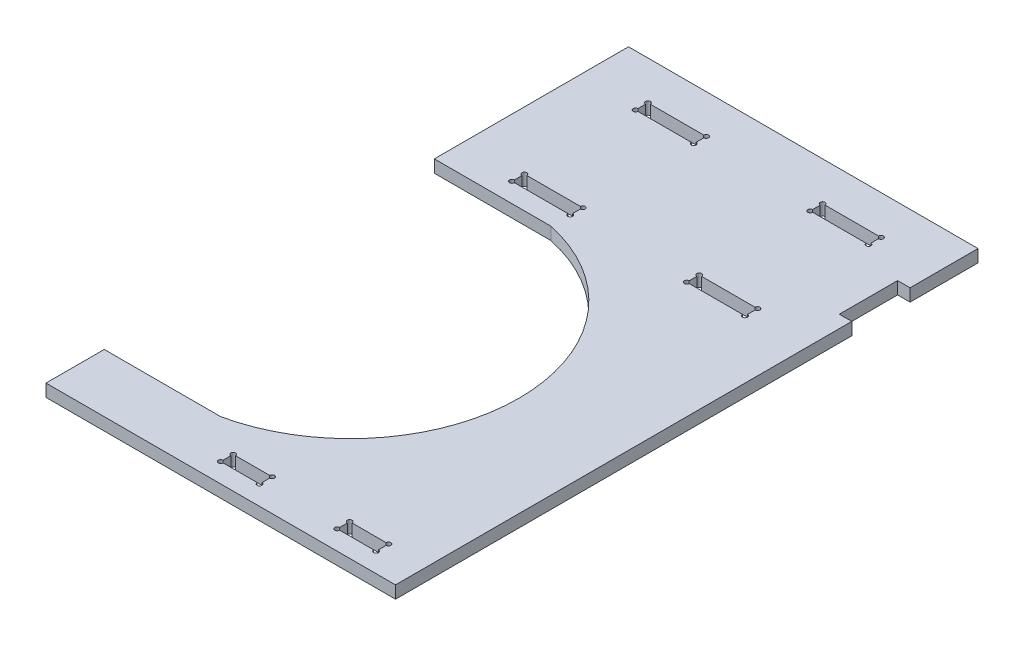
ISO-10303-21;
HEADER;
FILE_DESCRIPTION(('STEP AP214'),'2;1');
FILE_NAME('part.step','',(''),(''),'','','');
FILE_SCHEMA(('AUTOMOTIVE_DESIGN { 1 0 10303 214 1 1 1 1 }'));
ENDSEC;
DATA;
#1=APPLICATION_CONTEXT('core data for automotive mechanical design processes');
#2=APPLICATION_PROTOCOL_DEFINITION('international standard','automotive_design',2000,#1);
#3=PRODUCT_CONTEXT('',#1,'mechanical');
#4=PRODUCT('Part','Part','',(#3));
#5=PRODUCT_RELATED_PRODUCT_CATEGORY('part','',(#4));
#6=PRODUCT_DEFINITION_FORMATION('','',#4);
#7=PRODUCT_DEFINITION_CONTEXT('part definition',#1,'design');
#8=PRODUCT_DEFINITION('design','',#6,#7);
#9=PRODUCT_DEFINITION_SHAPE('','',#8);
#10=(LENGTH_UNIT() NAMED_UNIT(*) SI_UNIT(.MILLI.,.METRE.));
#11=(NAMED_UNIT(*) PLANE_ANGLE_UNIT() SI_UNIT($,.RADIAN.));
#12=(NAMED_UNIT(*) SI_UNIT($,.STERADIAN.) SOLID_ANGLE_UNIT());
#13=UNCERTAINTY_MEASURE_WITH_UNIT(LENGTH_MEASURE(1.E-05),#10,'distance_accuracy_value','');
#14=(GEOMETRIC_REPRESENTATION_CONTEXT(3) GLOBAL_UNCERTAINTY_ASSIGNED_CONTEXT((#13)) GLOBAL_UNIT_ASSIGNED_CONTEXT((#10,
#11,#12)) REPRESENTATION_CONTEXT('',''));
#15=CARTESIAN_POINT('',(0.,0.,0.));
#16=DIRECTION('',(0.,0.,1.));
#17=DIRECTION('',(1.,0.,0.));
#18=AXIS2_PLACEMENT_3D('',#15,#16,#17);
#19=CARTESIAN_POINT('',(105.656800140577,16.30000042,-292.1));
#20=DIRECTION('',(0.,-1.,0.));
#21=DIRECTION('',(0.,0.,-1.));
#22=AXIS2_PLACEMENT_3D('',#19,#20,#21);
#23=PLANE('',#22);
#24=DIRECTION('',(0.,0.,-1.));
#25=VECTOR('',#24,1.);
#26=CARTESIAN_POINT('',(152.4,16.30000042,-533.4));
#27=LINE('',#26,#25);
#28=CARTESIAN_POINT('',(152.4,16.30000042,-536.575));
#29=VERTEX_POINT('',#28);
#30=CARTESIAN_POINT('',(152.4,16.30000042,-546.52500042));
#31=VERTEX_POINT('',#30);
#32=EDGE_CURVE('E752',#29,#31,#27,.T.);
#33=ORIENTED_EDGE('',*,*,#32,.F.);
#34=CARTESIAN_POINT('',(152.4,16.30000042,-533.4));
#35=DIRECTION('',(0.,1.,0.));
#36=DIRECTION('',(0.,0.,1.));
#37=AXIS2_PLACEMENT_3D('',#34,#35,#36);
#38=CIRCLE('',#37,3.175);
#39=CARTESIAN_POINT('',(149.225,16.30000042,-533.4));
#40=VERTEX_POINT('',#39);
#41=EDGE_CURVE('E1056',#40,#29,#38,.T.);
#42=ORIENTED_EDGE('',*,*,#41,.F.);
#43=DIRECTION('',(1.,0.,0.));
#44=VECTOR('',#43,1.);
#45=CARTESIAN_POINT('',(76.2,16.30000042,-533.4));
#46=LINE('',#45,#44);
#47=CARTESIAN_POINT('',(79.375,16.30000042,-533.4));
#48=VERTEX_POINT('',#47);
#49=EDGE_CURVE('E748',#48,#40,#46,.T.);
#50=ORIENTED_EDGE('',*,*,#49,.F.);
#51=CARTESIAN_POINT('',(76.2,16.30000042,-533.4));
#52=DIRECTION('',(0.,1.,0.));
#53=DIRECTION('',(0.,0.,1.));
#54=AXIS2_PLACEMENT_3D('',#51,#52,#53);
#55=CIRCLE('',#54,3.175);
#56=CARTESIAN_POINT('',(76.2,16.30000042,-536.575));
#57=VERTEX_POINT('',#56);
#58=EDGE_CURVE('E1055',#57,#48,#55,.T.);
#59=ORIENTED_EDGE('',*,*,#58,.F.);
#60=DIRECTION('',(0.,0.,1.));
#61=VECTOR('',#60,1.);
#62=CARTESIAN_POINT('',(76.2,16.30000042,-549.70000042));
#63=LINE('',#62,#61);
#64=CARTESIAN_POINT('',(76.2,16.30000042,-546.52500042));
#65=VERTEX_POINT('',#64);
#66=EDGE_CURVE('E745',#65,#57,#63,.T.);
#67=ORIENTED_EDGE('',*,*,#66,.F.);
#68=CARTESIAN_POINT('',(76.2,16.30000042,-549.70000042));
#69=DIRECTION('',(0.,1.,0.));
#70=DIRECTION('',(0.,0.,1.));
#71=AXIS2_PLACEMENT_3D('',#68,#69,#70);
#72=CIRCLE('',#71,3.175);
#73=CARTESIAN_POINT('',(79.375,16.30000042,-549.70000042));
#74=VERTEX_POINT('',#73);
#75=EDGE_CURVE('E1069',#74,#65,#72,.T.);
#76=ORIENTED_EDGE('',*,*,#75,.F.);
#77=DIRECTION('',(-1.,0.,0.));
#78=VECTOR('',#77,1.);
#79=CARTESIAN_POINT('',(152.4,16.30000042,-549.70000042));
#80=LINE('',#79,#78);
#81=CARTESIAN_POINT('',(149.225,16.30000042,-549.70000042));
#82=VERTEX_POINT('',#81);
#83=EDGE_CURVE('E754',#82,#74,#80,.T.);
#84=ORIENTED_EDGE('',*,*,#83,.F.);
#85=CARTESIAN_POINT('',(152.4,16.30000042,-549.70000042));
#86=DIRECTION('',(0.,1.,0.));
#87=DIRECTION('',(0.,0.,1.));
#88=AXIS2_PLACEMENT_3D('',#85,#86,#87);
#89=CIRCLE('',#88,3.175);
#90=EDGE_CURVE('E1127',#31,#82,#89,.T.);
#91=ORIENTED_EDGE('',*,*,#90,.F.);
#92=EDGE_LOOP('',(#33,#42,#50,#59,#67,#76,#84,#91));
#93=FACE_BOUND('',#92,.T.);
#94=DIRECTION('',(-1.,0.,0.));
#95=VECTOR('',#94,1.);
#96=CARTESIAN_POINT('',(381.,16.30000042,-533.4));
#97=LINE('',#96,#95);
#98=CARTESIAN_POINT('',(377.825,16.30000042,-533.4));
#99=VERTEX_POINT('',#98);
#100=CARTESIAN_POINT('',(307.975,16.30000042,-533.4));
#101=VERTEX_POINT('',#100);
#102=EDGE_CURVE('E774',#99,#101,#97,.T.);
#103=ORIENTED_EDGE('',*,*,#102,.T.);
#104=CARTESIAN_POINT('',(304.8,16.30000042,-533.4));
#105=DIRECTION('',(0.,1.,0.));
#106=DIRECTION('',(0.,0.,1.));
#107=AXIS2_PLACEMENT_3D('',#104,#105,#106);
#108=CIRCLE('',#107,3.17499999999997);
#109=CARTESIAN_POINT('',(304.8,16.30000042,-536.575));
#110=VERTEX_POINT('',#109);
#111=EDGE_CURVE('E1172',#110,#101,#108,.T.);
#112=ORIENTED_EDGE('',*,*,#111,.F.);
#113=DIRECTION('',(0.,0.,-1.));
#114=VECTOR('',#113,1.);
#115=CARTESIAN_POINT('',(304.8,16.30000042,-533.4));
#116=LINE('',#115,#114);
#117=CARTESIAN_POINT('',(304.8,16.30000042,-546.52500042));
#118=VERTEX_POINT('',#117);
#119=EDGE_CURVE('E777',#110,#118,#116,.T.);
#120=ORIENTED_EDGE('',*,*,#119,.T.);
#121=CARTESIAN_POINT('',(304.8,16.30000042,-549.70000042));
#122=DIRECTION('',(0.,1.,0.));
#123=DIRECTION('',(0.,0.,1.));
#124=AXIS2_PLACEMENT_3D('',#121,#122,#123);
#125=CIRCLE('',#124,3.17499999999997);
#126=CARTESIAN_POINT('',(307.975,16.30000042,-549.70000042));
#127=VERTEX_POINT('',#126);
#128=EDGE_CURVE('E1171',#127,#118,#125,.T.);
#129=ORIENTED_EDGE('',*,*,#128,.F.);
#130=DIRECTION('',(1.,0.,0.));
#131=VECTOR('',#130,1.);
#132=CARTESIAN_POINT('',(304.8,16.30000042,-549.70000042));
#133=LINE('',#132,#131);
#134=CARTESIAN_POINT('',(377.825,16.30000042,-549.70000042));
#135=VERTEX_POINT('',#134);
#136=EDGE_CURVE('E767',#127,#135,#133,.T.);
#137=ORIENTED_EDGE('',*,*,#136,.T.);
#138=CARTESIAN_POINT('',(381.,16.30000042,-549.70000042));
#139=DIRECTION('',(0.,1.,0.));
#140=DIRECTION('',(0.,0.,1.));
#141=AXIS2_PLACEMENT_3D('',#138,#139,#140);
#142=CIRCLE('',#141,3.17499999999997);
#143=CARTESIAN_POINT('',(381.,16.30000042,-546.52500042));
#144=VERTEX_POINT('',#143);
#145=EDGE_CURVE('E1190',#144,#135,#142,.T.);
#146=ORIENTED_EDGE('',*,*,#145,.F.);
#147=DIRECTION('',(0.,0.,1.));
#148=VECTOR('',#147,1.);
#149=CARTESIAN_POINT('',(381.,16.30000042,-549.70000042));
#150=LINE('',#149,#148);
#151=CARTESIAN_POINT('',(381.,16.30000042,-536.575));
#152=VERTEX_POINT('',#151);
#153=EDGE_CURVE('E770',#144,#152,#150,.T.);
#154=ORIENTED_EDGE('',*,*,#153,.T.);
#155=CARTESIAN_POINT('',(381.,16.30000042,-533.4));
#156=DIRECTION('',(0.,1.,0.));
#157=DIRECTION('',(0.,0.,1.));
#158=AXIS2_PLACEMENT_3D('',#155,#156,#157);
#159=CIRCLE('',#158,3.17499999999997);
#160=EDGE_CURVE('E1185',#99,#152,#159,.T.);
#161=ORIENTED_EDGE('',*,*,#160,.F.);
#162=EDGE_LOOP('',(#103,#112,#120,#129,#137,#146,#154,#161));
#163=FACE_BOUND('',#162,.T.);
#164=DIRECTION('',(1.,0.,0.));
#165=VECTOR('',#164,1.);
#166=CARTESIAN_POINT('',(355.6,16.30000042,-41.70000042));
#167=LINE('',#166,#165);
#168=CARTESIAN_POINT('',(358.775,16.30000042,-41.70000042));
#169=VERTEX_POINT('',#168);
#170=CARTESIAN_POINT('',(403.225,16.30000042,-41.70000042));
#171=VERTEX_POINT('',#170);
#172=EDGE_CURVE('E801',#169,#171,#167,.T.);
#173=ORIENTED_EDGE('',*,*,#172,.T.);
#174=CARTESIAN_POINT('',(406.4,16.30000042,-41.70000042));
#175=DIRECTION('',(0.,1.,0.));
#176=DIRECTION('',(0.,0.,1.));
#177=AXIS2_PLACEMENT_3D('',#174,#175,#176);
#178=CIRCLE('',#177,3.17499999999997);
#179=CARTESIAN_POINT('',(406.4,16.30000042,-38.52500042));
#180=VERTEX_POINT('',#179);
#181=EDGE_CURVE('E1166',#180,#171,#178,.T.);
#182=ORIENTED_EDGE('',*,*,#181,.F.);
#183=DIRECTION('',(0.,0.,1.));
#184=VECTOR('',#183,1.);
#185=CARTESIAN_POINT('',(406.4,16.30000042,-41.70000042));
#186=LINE('',#185,#184);
#187=CARTESIAN_POINT('',(406.4,16.30000042,-28.575));
#188=VERTEX_POINT('',#187);
#189=EDGE_CURVE('E791',#180,#188,#186,.T.);
#190=ORIENTED_EDGE('',*,*,#189,.T.);
#191=CARTESIAN_POINT('',(406.4,16.30000042,-25.4));
#192=DIRECTION('',(0.,1.,0.));
#193=DIRECTION('',(0.,0.,1.));
#194=AXIS2_PLACEMENT_3D('',#191,#192,#193);
#195=CIRCLE('',#194,3.17499999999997);
#196=CARTESIAN_POINT('',(403.225,16.30000042,-25.4));
#197=VERTEX_POINT('',#196);
#198=EDGE_CURVE('E1177',#197,#188,#195,.T.);
#199=ORIENTED_EDGE('',*,*,#198,.F.);
#200=DIRECTION('',(-1.,0.,0.));
#201=VECTOR('',#200,1.);
#202=CARTESIAN_POINT('',(406.4,16.30000042,-25.4));
#203=LINE('',#202,#201);
#204=CARTESIAN_POINT('',(358.775,16.30000042,-25.4));
#205=VERTEX_POINT('',#204);
#206=EDGE_CURVE('E794',#197,#205,#203,.T.);
#207=ORIENTED_EDGE('',*,*,#206,.T.);
#208=CARTESIAN_POINT('',(355.6,16.30000042,-25.4));
#209=DIRECTION('',(0.,1.,0.));
#210=DIRECTION('',(0.,0.,1.));
#211=AXIS2_PLACEMENT_3D('',#208,#209,#210);
#212=CIRCLE('',#211,3.17499999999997);
#213=CARTESIAN_POINT('',(355.6,16.30000042,-28.5749999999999));
#214=VERTEX_POINT('',#213);
#215=EDGE_CURVE('E1160',#214,#205,#212,.T.);
#216=ORIENTED_EDGE('',*,*,#215,.F.);
#217=DIRECTION('',(0.,0.,-1.));
#218=VECTOR('',#217,1.);
#219=CARTESIAN_POINT('',(355.6,16.30000042,-25.4));
#220=LINE('',#219,#218);
#221=CARTESIAN_POINT('',(355.6,16.30000042,-38.52500042));
#222=VERTEX_POINT('',#221);
#223=EDGE_CURVE('E798',#214,#222,#220,.T.);
#224=ORIENTED_EDGE('',*,*,#223,.T.);
#225=CARTESIAN_POINT('',(355.6,16.30000042,-41.70000042));
#226=DIRECTION('',(0.,1.,0.));
#227=DIRECTION('',(0.,0.,1.));
#228=AXIS2_PLACEMENT_3D('',#225,#226,#227);
#229=CIRCLE('',#228,3.17499999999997);
#230=EDGE_CURVE('E1159',#169,#222,#229,.T.);
#231=ORIENTED_EDGE('',*,*,#230,.F.);
#232=EDGE_LOOP('',(#173,#182,#190,#199,#207,#216,#224,#231));
#233=FACE_BOUND('',#232,.T.);
#234=DIRECTION('',(0.,0.,1.));
#235=VECTOR('',#234,1.);
#236=CARTESIAN_POINT('',(304.8,16.30000042,-711.2));
#237=LINE('',#236,#235);
#238=CARTESIAN_POINT('',(304.8,16.30000042,-708.025));
#239=VERTEX_POINT('',#238);
#240=CARTESIAN_POINT('',(304.8,16.30000042,-698.07499958));
#241=VERTEX_POINT('',#240);
#242=EDGE_CURVE('E842',#239,#241,#237,.T.);
#243=ORIENTED_EDGE('',*,*,#242,.F.);
#244=CARTESIAN_POINT('',(304.8,16.30000042,-711.2));
#245=DIRECTION('',(0.,1.,0.));
#246=DIRECTION('',(0.,0.,1.));
#247=AXIS2_PLACEMENT_3D('',#244,#245,#246);
#248=CIRCLE('',#247,3.17499999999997);
#249=CARTESIAN_POINT('',(307.975,16.30000042,-711.2));
#250=VERTEX_POINT('',#249);
#251=EDGE_CURVE('E335',#250,#239,#248,.T.);
#252=ORIENTED_EDGE('',*,*,#251,.F.);
#253=DIRECTION('',(-1.,0.,0.));
#254=VECTOR('',#253,1.);
#255=CARTESIAN_POINT('',(381.,16.30000042,-711.2));
#256=LINE('',#255,#254);
#257=CARTESIAN_POINT('',(377.825,16.30000042,-711.2));
#258=VERTEX_POINT('',#257);
#259=EDGE_CURVE('E839',#258,#250,#256,.T.);
#260=ORIENTED_EDGE('',*,*,#259,.F.);
#261=CARTESIAN_POINT('',(381.,16.30000042,-711.2));
#262=DIRECTION('',(0.,1.,0.));
#263=DIRECTION('',(0.,0.,1.));
#264=AXIS2_PLACEMENT_3D('',#261,#262,#263);
#265=CIRCLE('',#264,3.17499999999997);
#266=CARTESIAN_POINT('',(381.,16.30000042,-708.025));
#267=VERTEX_POINT('',#266);
#268=EDGE_CURVE('E1026',#267,#258,#265,.T.);
#269=ORIENTED_EDGE('',*,*,#268,.F.);
#270=DIRECTION('',(0.,0.,1.));
#271=VECTOR('',#270,1.);
#272=CARTESIAN_POINT('',(381.,16.30000042,-711.2));
#273=LINE('',#272,#271);
#274=CARTESIAN_POINT('',(381.,16.30000042,-698.07499958));
#275=VERTEX_POINT('',#274);
#276=EDGE_CURVE('E849',#267,#275,#273,.T.);
#277=ORIENTED_EDGE('',*,*,#276,.T.);
#278=CARTESIAN_POINT('',(381.,16.30000042,-694.89999958));
#279=DIRECTION('',(0.,1.,0.));
#280=DIRECTION('',(0.,0.,1.));
#281=AXIS2_PLACEMENT_3D('',#278,#279,#280);
#282=CIRCLE('',#281,3.17499999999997);
#283=CARTESIAN_POINT('',(377.825,16.30000042,-694.89999958));
#284=VERTEX_POINT('',#283);
#285=EDGE_CURVE('E1018',#284,#275,#282,.T.);
#286=ORIENTED_EDGE('',*,*,#285,.F.);
#287=DIRECTION('',(-1.,0.,0.));
#288=VECTOR('',#287,1.);
#289=CARTESIAN_POINT('',(381.,16.30000042,-694.89999958));
#290=LINE('',#289,#288);
#291=CARTESIAN_POINT('',(307.975,16.30000042,-694.89999958));
#292=VERTEX_POINT('',#291);
#293=EDGE_CURVE('E846',#284,#292,#290,.T.);
#294=ORIENTED_EDGE('',*,*,#293,.T.);
#295=CARTESIAN_POINT('',(304.8,16.30000042,-694.89999958));
#296=DIRECTION('',(0.,1.,0.));
#297=DIRECTION('',(0.,0.,1.));
#298=AXIS2_PLACEMENT_3D('',#295,#296,#297);
#299=CIRCLE('',#298,3.17499999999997);
#300=EDGE_CURVE('E343',#241,#292,#299,.T.);
#301=ORIENTED_EDGE('',*,*,#300,.F.);
#302=EDGE_LOOP('',(#243,#252,#260,#269,#277,#286,#294,#301));
#303=FACE_BOUND('',#302,.T.);
#304=DIRECTION('',(0.,0.,-1.));
#305=VECTOR('',#304,1.);
#306=CARTESIAN_POINT('',(0.,16.30000042,0.));
#307=LINE('',#306,#305);
#308=CARTESIAN_POINT('',(0.,16.30000042,0.));
#309=VERTEX_POINT('',#308);
#310=CARTESIAN_POINT('',(0.,16.30000042,-76.2));
#311=VERTEX_POINT('',#310);
#312=EDGE_CURVE('E863',#309,#311,#307,.T.);
#313=ORIENTED_EDGE('',*,*,#312,.F.);
#314=DIRECTION('',(1.,0.,0.));
#315=VECTOR('',#314,1.);
#316=CARTESIAN_POINT('',(0.,16.30000042,0.));
#317=LINE('',#316,#315);
#318=CARTESIAN_POINT('',(457.2,16.30000042,0.));
#319=VERTEX_POINT('',#318);
#320=EDGE_CURVE('E893',#309,#319,#317,.T.);
#321=ORIENTED_EDGE('',*,*,#320,.T.);
#322=DIRECTION('',(0.,0.,1.));
#323=VECTOR('',#322,1.);
#324=CARTESIAN_POINT('',(457.2,16.30000042,-596.9));
#325=LINE('',#324,#323);
#326=CARTESIAN_POINT('',(457.2,16.30000042,-596.9));
#327=VERTEX_POINT('',#326);
#328=EDGE_CURVE('E890',#327,#319,#325,.T.);
#329=ORIENTED_EDGE('',*,*,#328,.F.);
#330=DIRECTION('',(1.,0.,0.));
#331=VECTOR('',#330,1.);
#332=CARTESIAN_POINT('',(440.89999958,16.30000042,-596.9));
#333=LINE('',#332,#331);
#334=CARTESIAN_POINT('',(440.89999958,16.30000042,-596.9));
#335=VERTEX_POINT('',#334);
#336=EDGE_CURVE('E887',#335,#327,#333,.T.);
#337=ORIENTED_EDGE('',*,*,#336,.F.);
#338=DIRECTION('',(0.,0.,1.));
#339=VECTOR('',#338,1.);
#340=CARTESIAN_POINT('',(440.89999958,16.30000042,-673.1));
#341=LINE('',#340,#339);
#342=CARTESIAN_POINT('',(440.89999958,16.30000042,-673.1));
#343=VERTEX_POINT('',#342);
#344=EDGE_CURVE('E884',#343,#335,#341,.T.);
#345=ORIENTED_EDGE('',*,*,#344,.F.);
#346=DIRECTION('',(-1.,0.,0.));
#347=VECTOR('',#346,1.);
#348=CARTESIAN_POINT('',(457.2,16.30000042,-673.1));
#349=LINE('',#348,#347);
#350=CARTESIAN_POINT('',(457.2,16.30000042,-673.1));
#351=VERTEX_POINT('',#350);
#352=EDGE_CURVE('E881',#351,#343,#349,.T.);
#353=ORIENTED_EDGE('',*,*,#352,.F.);
#354=DIRECTION('',(0.,0.,1.));
#355=VECTOR('',#354,1.);
#356=CARTESIAN_POINT('',(457.2,16.30000042,-762.));
#357=LINE('',#356,#355);
#358=CARTESIAN_POINT('',(457.2,16.30000042,-762.));
#359=VERTEX_POINT('',#358);
#360=EDGE_CURVE('E878',#359,#351,#357,.T.);
#361=ORIENTED_EDGE('',*,*,#360,.F.);
#362=DIRECTION('',(-1.,0.,0.));
#363=VECTOR('',#362,1.);
#364=CARTESIAN_POINT('',(457.2,16.30000042,-762.));
#365=LINE('',#364,#363);
#366=CARTESIAN_POINT('',(0.,16.30000042,-762.));
#367=VERTEX_POINT('',#366);
#368=EDGE_CURVE('E876',#359,#367,#365,.T.);
#369=ORIENTED_EDGE('',*,*,#368,.T.);
#370=DIRECTION('',(0.,0.,1.));
#371=VECTOR('',#370,1.);
#372=CARTESIAN_POINT('',(0.,16.30000042,-762.));
#373=LINE('',#372,#371);
#374=CARTESIAN_POINT('',(0.,16.30000042,-508.));
#375=VERTEX_POINT('',#374);
#376=EDGE_CURVE('E874',#367,#375,#373,.T.);
#377=ORIENTED_EDGE('',*,*,#376,.T.);
#378=DIRECTION('',(1.,0.,0.));
#379=VECTOR('',#378,1.);
#380=CARTESIAN_POINT('',(0.,16.30000042,-508.));
#381=LINE('',#380,#379);
#382=CARTESIAN_POINT('',(152.4,16.30000042,-508.));
#383=VERTEX_POINT('',#382);
#384=EDGE_CURVE('E872',#375,#383,#381,.T.);
#385=ORIENTED_EDGE('',*,*,#384,.T.);
#386=CARTESIAN_POINT('',(105.656800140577,16.30000042,-292.1));
#387=DIRECTION('',(0.,-1.,0.));
#388=DIRECTION('',(0.,0.,-1.));
#389=AXIS2_PLACEMENT_3D('',#386,#387,#388);
#390=CIRCLE('',#389,220.902097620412);
#391=CARTESIAN_POINT('',(152.4,16.30000042,-76.1999999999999));
#392=VERTEX_POINT('',#391);
#393=EDGE_CURVE('E870',#383,#392,#390,.T.);
#394=ORIENTED_EDGE('',*,*,#393,.T.);
#395=DIRECTION('',(1.,0.,0.));
#396=VECTOR('',#395,1.);
#397=CARTESIAN_POINT('',(0.,16.30000042,-76.2));
#398=LINE('',#397,#396);
#399=EDGE_CURVE('E866',#311,#392,#398,.T.);
#400=ORIENTED_EDGE('',*,*,#399,.F.);
#401=EDGE_LOOP('',(#313,#321,#329,#337,#345,#353,#361,#369,#377,#385,#394,#400));
#402=FACE_BOUND('',#401,.T.);
#403=DIRECTION('',(0.,0.,1.));
#404=VECTOR('',#403,1.);
#405=CARTESIAN_POINT('',(76.2,16.30000042,-711.2));
#406=LINE('',#405,#404);
#407=CARTESIAN_POINT('',(76.2,16.30000042,-708.025));
#408=VERTEX_POINT('',#407);
#409=CARTESIAN_POINT('',(76.2,16.30000042,-698.07499958));
#410=VERTEX_POINT('',#409);
#411=EDGE_CURVE('E815',#408,#410,#406,.T.);
#412=ORIENTED_EDGE('',*,*,#411,.F.);
#413=CARTESIAN_POINT('',(76.2,16.30000042,-711.2));
#414=DIRECTION('',(0.,1.,0.));
#415=DIRECTION('',(0.,0.,1.));
#416=AXIS2_PLACEMENT_3D('',#413,#414,#415);
#417=CIRCLE('',#416,3.175);
#418=CARTESIAN_POINT('',(79.375,16.30000042,-711.2));
#419=VERTEX_POINT('',#418);
#420=EDGE_CURVE('E1040',#419,#408,#417,.T.);
#421=ORIENTED_EDGE('',*,*,#420,.F.);
#422=DIRECTION('',(1.,0.,0.));
#423=VECTOR('',#422,1.);
#424=CARTESIAN_POINT('',(76.2,16.30000042,-711.2));
#425=LINE('',#424,#423);
#426=CARTESIAN_POINT('',(149.225,16.30000042,-711.2));
#427=VERTEX_POINT('',#426);
#428=EDGE_CURVE('E825',#419,#427,#425,.T.);
#429=ORIENTED_EDGE('',*,*,#428,.T.);
#430=CARTESIAN_POINT('',(152.4,16.30000042,-711.2));
#431=DIRECTION('',(0.,1.,0.));
#432=DIRECTION('',(0.,0.,1.));
#433=AXIS2_PLACEMENT_3D('',#430,#431,#432);
#434=CIRCLE('',#433,3.175);
#435=CARTESIAN_POINT('',(152.4,16.30000042,-708.025));
#436=VERTEX_POINT('',#435);
#437=EDGE_CURVE('E1061',#436,#427,#434,.T.);
#438=ORIENTED_EDGE('',*,*,#437,.F.);
#439=DIRECTION('',(0.,0.,1.));
#440=VECTOR('',#439,1.);
#441=CARTESIAN_POINT('',(152.4,16.30000042,-711.2));
#442=LINE('',#441,#440);
#443=CARTESIAN_POINT('',(152.4,16.30000042,-698.07499958));
#444=VERTEX_POINT('',#443);
#445=EDGE_CURVE('E822',#436,#444,#442,.T.);
#446=ORIENTED_EDGE('',*,*,#445,.T.);
#447=CARTESIAN_POINT('',(152.4,16.30000042,-694.89999958));
#448=DIRECTION('',(0.,1.,0.));
#449=DIRECTION('',(0.,0.,1.));
#450=AXIS2_PLACEMENT_3D('',#447,#448,#449);
#451=CIRCLE('',#450,3.175);
#452=CARTESIAN_POINT('',(149.225,16.30000042,-694.89999958));
#453=VERTEX_POINT('',#452);
#454=EDGE_CURVE('E1046',#453,#444,#451,.T.);
#455=ORIENTED_EDGE('',*,*,#454,.F.);
#456=DIRECTION('',(1.,0.,0.));
#457=VECTOR('',#456,1.);
#458=CARTESIAN_POINT('',(76.2,16.30000042,-694.89999958));
#459=LINE('',#458,#457);
#460=CARTESIAN_POINT('',(79.375,16.30000042,-694.89999958));
#461=VERTEX_POINT('',#460);
#462=EDGE_CURVE('E818',#461,#453,#459,.T.);
#463=ORIENTED_EDGE('',*,*,#462,.F.);
#464=CARTESIAN_POINT('',(76.2,16.30000042,-694.89999958));
#465=DIRECTION('',(0.,1.,0.));
#466=DIRECTION('',(0.,0.,1.));
#467=AXIS2_PLACEMENT_3D('',#464,#465,#466);
#468=CIRCLE('',#467,3.175);
#469=EDGE_CURVE('E1041',#410,#461,#468,.T.);
#470=ORIENTED_EDGE('',*,*,#469,.F.);
#471=EDGE_LOOP('',(#412,#421,#429,#438,#446,#455,#463,#470));
#472=FACE_BOUND('',#471,.T.);
#473=DIRECTION('',(1.,0.,0.));
#474=VECTOR('',#473,1.);
#475=CARTESIAN_POINT('',(203.2,16.30000042,-25.3999999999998));
#476=LINE('',#475,#474);
#477=CARTESIAN_POINT('',(206.375,16.30000042,-25.3999999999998));
#478=VERTEX_POINT('',#477);
#479=CARTESIAN_POINT('',(250.825,16.30000042,-25.3999999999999));
#480=VERTEX_POINT('',#479);
#481=EDGE_CURVE('E729',#478,#480,#476,.T.);
#482=ORIENTED_EDGE('',*,*,#481,.F.);
#483=CARTESIAN_POINT('',(203.2,16.30000042,-25.3999999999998));
#484=DIRECTION('',(0.,1.,0.));
#485=DIRECTION('',(0.,0.,1.));
#486=AXIS2_PLACEMENT_3D('',#483,#484,#485);
#487=CIRCLE('',#486,3.175);
#488=CARTESIAN_POINT('',(203.2,16.30000042,-28.5749999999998));
#489=VERTEX_POINT('',#488);
#490=EDGE_CURVE('E1140',#489,#478,#487,.T.);
#491=ORIENTED_EDGE('',*,*,#490,.F.);
#492=DIRECTION('',(0.,0.,1.));
#493=VECTOR('',#492,1.);
#494=CARTESIAN_POINT('',(203.2,16.30000042,-41.7000004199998));
#495=LINE('',#494,#493);
#496=CARTESIAN_POINT('',(203.2,16.30000042,-38.5250004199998));
#497=VERTEX_POINT('',#496);
#498=EDGE_CURVE('E718',#497,#489,#495,.T.);
#499=ORIENTED_EDGE('',*,*,#498,.F.);
#500=CARTESIAN_POINT('',(203.2,16.30000042,-41.7000004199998));
#501=DIRECTION('',(0.,1.,0.));
#502=DIRECTION('',(0.,0.,1.));
#503=AXIS2_PLACEMENT_3D('',#500,#501,#502);
#504=CIRCLE('',#503,3.175);
#505=CARTESIAN_POINT('',(206.375,16.30000042,-41.7000004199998));
#506=VERTEX_POINT('',#505);
#507=EDGE_CURVE('E699',#506,#497,#504,.T.);
#508=ORIENTED_EDGE('',*,*,#507,.F.);
#509=DIRECTION('',(-1.,0.,0.));
#510=VECTOR('',#509,1.);
#511=CARTESIAN_POINT('',(254.,16.30000042,-41.7000004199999));
#512=LINE('',#511,#510);
#513=CARTESIAN_POINT('',(250.825,16.30000042,-41.7000004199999));
#514=VERTEX_POINT('',#513);
#515=EDGE_CURVE('E715',#514,#506,#512,.T.);
#516=ORIENTED_EDGE('',*,*,#515,.F.);
#517=CARTESIAN_POINT('',(254.,16.30000042,-41.7000004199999));
#518=DIRECTION('',(0.,1.,0.));
#519=DIRECTION('',(0.,0.,1.));
#520=AXIS2_PLACEMENT_3D('',#517,#518,#519);
#521=CIRCLE('',#520,3.17499999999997);
#522=CARTESIAN_POINT('',(254.,16.30000042,-38.5250004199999));
#523=VERTEX_POINT('',#522);
#524=EDGE_CURVE('E1149',#523,#514,#521,.T.);
#525=ORIENTED_EDGE('',*,*,#524,.F.);
#526=DIRECTION('',(0.,0.,-1.));
#527=VECTOR('',#526,1.);
#528=CARTESIAN_POINT('',(254.,16.30000042,-25.3999999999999));
#529=LINE('',#528,#527);
#530=CARTESIAN_POINT('',(254.,16.30000042,-28.5749999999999));
#531=VERTEX_POINT('',#530);
#532=EDGE_CURVE('E724',#531,#523,#529,.T.);
#533=ORIENTED_EDGE('',*,*,#532,.F.);
#534=CARTESIAN_POINT('',(254.,16.30000042,-25.3999999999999));
#535=DIRECTION('',(0.,1.,0.));
#536=DIRECTION('',(0.,0.,1.));
#537=AXIS2_PLACEMENT_3D('',#534,#535,#536);
#538=CIRCLE('',#537,3.17499999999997);
#539=EDGE_CURVE('E1142',#480,#531,#538,.T.);
#540=ORIENTED_EDGE('',*,*,#539,.F.);
#541=EDGE_LOOP('',(#482,#491,#499,#508,#516,#525,#533,#540));
#542=FACE_BOUND('',#541,.T.);
#543=ADVANCED_FACE('F321',(#93,#163,#233,#303,#402,#472,#542),#23,.F.);
#544=CARTESIAN_POINT('',(105.656800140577,0.,-292.1));
#545=DIRECTION('',(0.,-1.,0.));
#546=DIRECTION('',(0.,0.,-1.));
#547=AXIS2_PLACEMENT_3D('',#544,#545,#546);
#548=PLANE('',#547);
#549=CARTESIAN_POINT('',(406.4,0.,-41.70000042));
#550=DIRECTION('',(0.,1.,0.));
#551=DIRECTION('',(0.,0.,1.));
#552=AXIS2_PLACEMENT_3D('',#549,#550,#551);
#553=CIRCLE('',#552,3.17499999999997);
#554=CARTESIAN_POINT('',(406.4,0.,-38.52500042));
#555=VERTEX_POINT('',#554);
#556=CARTESIAN_POINT('',(403.225,0.,-41.70000042));
#557=VERTEX_POINT('',#556);
#558=EDGE_CURVE('E1179',#555,#557,#553,.T.);
#559=ORIENTED_EDGE('',*,*,#558,.T.);
#560=DIRECTION('',(1.,0.,0.));
#561=VECTOR('',#560,1.);
#562=CARTESIAN_POINT('',(355.6,0.,-41.70000042));
#563=LINE('',#562,#561);
#564=CARTESIAN_POINT('',(358.775,0.,-41.70000042));
#565=VERTEX_POINT('',#564);
#566=EDGE_CURVE('E795',#565,#557,#563,.T.);
#567=ORIENTED_EDGE('',*,*,#566,.F.);
#568=CARTESIAN_POINT('',(355.6,0.,-41.70000042));
#569=DIRECTION('',(0.,1.,0.));
#570=DIRECTION('',(0.,0.,1.));
#571=AXIS2_PLACEMENT_3D('',#568,#569,#570);
#572=CIRCLE('',#571,3.17499999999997);
#573=CARTESIAN_POINT('',(355.6,0.,-38.52500042));
#574=VERTEX_POINT('',#573);
#575=EDGE_CURVE('E1163',#565,#574,#572,.T.);
#576=ORIENTED_EDGE('',*,*,#575,.T.);
#577=DIRECTION('',(0.,0.,-1.));
#578=VECTOR('',#577,1.);
#579=CARTESIAN_POINT('',(355.6,0.,-25.4));
#580=LINE('',#579,#578);
#581=CARTESIAN_POINT('',(355.6,0.,-28.5749999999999));
#582=VERTEX_POINT('',#581);
#583=EDGE_CURVE('E810',#582,#574,#580,.T.);
#584=ORIENTED_EDGE('',*,*,#583,.F.);
#585=CARTESIAN_POINT('',(355.6,0.,-25.4));
#586=DIRECTION('',(0.,1.,0.));
#587=DIRECTION('',(0.,0.,1.));
#588=AXIS2_PLACEMENT_3D('',#585,#586,#587);
#589=CIRCLE('',#588,3.17499999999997);
#590=CARTESIAN_POINT('',(358.775,0.,-25.4));
#591=VERTEX_POINT('',#590);
#592=EDGE_CURVE('E1156',#582,#591,#589,.T.);
#593=ORIENTED_EDGE('',*,*,#592,.T.);
#594=DIRECTION('',(-1.,0.,0.));
#595=VECTOR('',#594,1.);
#596=CARTESIAN_POINT('',(406.4,0.,-25.4));
#597=LINE('',#596,#595);
#598=CARTESIAN_POINT('',(403.225,0.,-25.4));
#599=VERTEX_POINT('',#598);
#600=EDGE_CURVE('E807',#599,#591,#597,.T.);
#601=ORIENTED_EDGE('',*,*,#600,.F.);
#602=CARTESIAN_POINT('',(406.4,0.,-25.4));
#603=DIRECTION('',(0.,1.,0.));
#604=DIRECTION('',(0.,0.,1.));
#605=AXIS2_PLACEMENT_3D('',#602,#603,#604);
#606=CIRCLE('',#605,3.17499999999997);
#607=CARTESIAN_POINT('',(406.4,0.,-28.575));
#608=VERTEX_POINT('',#607);
#609=EDGE_CURVE('E1174',#599,#608,#606,.T.);
#610=ORIENTED_EDGE('',*,*,#609,.T.);
#611=DIRECTION('',(0.,0.,1.));
#612=VECTOR('',#611,1.);
#613=CARTESIAN_POINT('',(406.4,0.,-41.70000042));
#614=LINE('',#613,#612);
#615=EDGE_CURVE('E780',#555,#608,#614,.T.);
#616=ORIENTED_EDGE('',*,*,#615,.F.);
#617=EDGE_LOOP('',(#559,#567,#576,#584,#593,#601,#610,#616));
#618=FACE_BOUND('',#617,.T.);
#619=CARTESIAN_POINT('',(304.8,0.,-533.4));
#620=DIRECTION('',(0.,1.,0.));
#621=DIRECTION('',(0.,0.,1.));
#622=AXIS2_PLACEMENT_3D('',#619,#620,#621);
#623=CIRCLE('',#622,3.17499999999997);
#624=CARTESIAN_POINT('',(304.8,0.,-536.575));
#625=VERTEX_POINT('',#624);
#626=CARTESIAN_POINT('',(307.975,0.,-533.4));
#627=VERTEX_POINT('',#626);
#628=EDGE_CURVE('E1168',#625,#627,#623,.T.);
#629=ORIENTED_EDGE('',*,*,#628,.T.);
#630=DIRECTION('',(-1.,0.,0.));
#631=VECTOR('',#630,1.);
#632=CARTESIAN_POINT('',(381.,0.,-533.4));
#633=LINE('',#632,#631);
#634=CARTESIAN_POINT('',(377.825,0.,-533.4));
#635=VERTEX_POINT('',#634);
#636=EDGE_CURVE('E786',#635,#627,#633,.T.);
#637=ORIENTED_EDGE('',*,*,#636,.F.);
#638=CARTESIAN_POINT('',(381.,0.,-533.4));
#639=DIRECTION('',(0.,1.,0.));
#640=DIRECTION('',(0.,0.,1.));
#641=AXIS2_PLACEMENT_3D('',#638,#639,#640);
#642=CIRCLE('',#641,3.17499999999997);
#643=CARTESIAN_POINT('',(381.,0.,-536.575));
#644=VERTEX_POINT('',#643);
#645=EDGE_CURVE('E1036',#635,#644,#642,.T.);
#646=ORIENTED_EDGE('',*,*,#645,.T.);
#647=DIRECTION('',(0.,0.,1.));
#648=VECTOR('',#647,1.);
#649=CARTESIAN_POINT('',(381.,0.,-549.70000042));
#650=LINE('',#649,#648);
#651=CARTESIAN_POINT('',(381.,0.,-546.52500042));
#652=VERTEX_POINT('',#651);
#653=EDGE_CURVE('E783',#652,#644,#650,.T.);
#654=ORIENTED_EDGE('',*,*,#653,.F.);
#655=CARTESIAN_POINT('',(381.,0.,-549.70000042));
#656=DIRECTION('',(0.,1.,0.));
#657=DIRECTION('',(0.,0.,1.));
#658=AXIS2_PLACEMENT_3D('',#655,#656,#657);
#659=CIRCLE('',#658,3.17499999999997);
#660=CARTESIAN_POINT('',(377.825,0.,-549.70000042));
#661=VERTEX_POINT('',#660);
#662=EDGE_CURVE('E1187',#652,#661,#659,.T.);
#663=ORIENTED_EDGE('',*,*,#662,.T.);
#664=DIRECTION('',(1.,0.,0.));
#665=VECTOR('',#664,1.);
#666=CARTESIAN_POINT('',(304.8,0.,-549.70000042));
#667=LINE('',#666,#665);
#668=CARTESIAN_POINT('',(307.975,0.,-549.70000042));
#669=VERTEX_POINT('',#668);
#670=EDGE_CURVE('E757',#669,#661,#667,.T.);
#671=ORIENTED_EDGE('',*,*,#670,.F.);
#672=CARTESIAN_POINT('',(304.8,0.,-549.70000042));
#673=DIRECTION('',(0.,1.,0.));
#674=DIRECTION('',(0.,0.,1.));
#675=AXIS2_PLACEMENT_3D('',#672,#673,#674);
#676=CIRCLE('',#675,3.17499999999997);
#677=CARTESIAN_POINT('',(304.8,0.,-546.52500042));
#678=VERTEX_POINT('',#677);
#679=EDGE_CURVE('E1192',#669,#678,#676,.T.);
#680=ORIENTED_EDGE('',*,*,#679,.T.);
#681=DIRECTION('',(0.,0.,-1.));
#682=VECTOR('',#681,1.);
#683=CARTESIAN_POINT('',(304.8,0.,-533.4));
#684=LINE('',#683,#682);
#685=EDGE_CURVE('E771',#625,#678,#684,.T.);
#686=ORIENTED_EDGE('',*,*,#685,.F.);
#687=EDGE_LOOP('',(#629,#637,#646,#654,#663,#671,#680,#686));
#688=FACE_BOUND('',#687,.T.);
#689=CARTESIAN_POINT('',(203.2,0.,-25.3999999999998));
#690=DIRECTION('',(0.,1.,0.));
#691=DIRECTION('',(0.,0.,1.));
#692=AXIS2_PLACEMENT_3D('',#689,#690,#691);
#693=CIRCLE('',#692,3.175);
#694=CARTESIAN_POINT('',(203.2,0.,-28.5749999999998));
#695=VERTEX_POINT('',#694);
#696=CARTESIAN_POINT('',(206.375,0.,-25.3999999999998));
#697=VERTEX_POINT('',#696);
#698=EDGE_CURVE('E1146',#695,#697,#693,.T.);
#699=ORIENTED_EDGE('',*,*,#698,.T.);
#700=DIRECTION('',(1.,0.,0.));
#701=VECTOR('',#700,1.);
#702=CARTESIAN_POINT('',(203.2,0.,-25.3999999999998));
#703=LINE('',#702,#701);
#704=CARTESIAN_POINT('',(250.825,0.,-25.3999999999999));
#705=VERTEX_POINT('',#704);
#706=EDGE_CURVE('E733',#697,#705,#703,.T.);
#707=ORIENTED_EDGE('',*,*,#706,.T.);
#708=CARTESIAN_POINT('',(254.,0.,-25.3999999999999));
#709=DIRECTION('',(0.,1.,0.));
#710=DIRECTION('',(0.,0.,1.));
#711=AXIS2_PLACEMENT_3D('',#708,#709,#710);
#712=CIRCLE('',#711,3.17499999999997);
#713=CARTESIAN_POINT('',(254.,0.,-28.5749999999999));
#714=VERTEX_POINT('',#713);
#715=EDGE_CURVE('E1145',#705,#714,#712,.T.);
#716=ORIENTED_EDGE('',*,*,#715,.T.);
#717=DIRECTION('',(0.,0.,-1.));
#718=VECTOR('',#717,1.);
#719=CARTESIAN_POINT('',(254.,0.,-25.3999999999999));
#720=LINE('',#719,#718);
#721=CARTESIAN_POINT('',(254.,0.,-38.5250004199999));
#722=VERTEX_POINT('',#721);
#723=EDGE_CURVE('E736',#714,#722,#720,.T.);
#724=ORIENTED_EDGE('',*,*,#723,.T.);
#725=CARTESIAN_POINT('',(254.,0.,-41.7000004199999));
#726=DIRECTION('',(0.,1.,0.));
#727=DIRECTION('',(0.,0.,1.));
#728=AXIS2_PLACEMENT_3D('',#725,#726,#727);
#729=CIRCLE('',#728,3.17499999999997);
#730=CARTESIAN_POINT('',(250.825,0.,-41.7000004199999));
#731=VERTEX_POINT('',#730);
#732=EDGE_CURVE('E719',#722,#731,#729,.T.);
#733=ORIENTED_EDGE('',*,*,#732,.T.);
#734=DIRECTION('',(-1.,0.,0.));
#735=VECTOR('',#734,1.);
#736=CARTESIAN_POINT('',(254.,0.,-41.7000004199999));
#737=LINE('',#736,#735);
#738=CARTESIAN_POINT('',(206.375,0.,-41.7000004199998));
#739=VERTEX_POINT('',#738);
#740=EDGE_CURVE('E740',#731,#739,#737,.T.);
#741=ORIENTED_EDGE('',*,*,#740,.T.);
#742=CARTESIAN_POINT('',(203.2,0.,-41.7000004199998));
#743=DIRECTION('',(0.,1.,0.));
#744=DIRECTION('',(0.,0.,1.));
#745=AXIS2_PLACEMENT_3D('',#742,#743,#744);
#746=CIRCLE('',#745,3.175);
#747=CARTESIAN_POINT('',(203.2,0.,-38.5250004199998));
#748=VERTEX_POINT('',#747);
#749=EDGE_CURVE('E702',#739,#748,#746,.T.);
#750=ORIENTED_EDGE('',*,*,#749,.T.);
#751=DIRECTION('',(0.,0.,1.));
#752=VECTOR('',#751,1.);
#753=CARTESIAN_POINT('',(203.2,0.,-41.7000004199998));
#754=LINE('',#753,#752);
#755=EDGE_CURVE('E742',#748,#695,#754,.T.);
#756=ORIENTED_EDGE('',*,*,#755,.T.);
#757=EDGE_LOOP('',(#699,#707,#716,#724,#733,#741,#750,#756));
#758=FACE_BOUND('',#757,.T.);
#759=CARTESIAN_POINT('',(76.2,0.,-711.2));
#760=DIRECTION('',(0.,1.,0.));
#761=DIRECTION('',(0.,0.,1.));
#762=AXIS2_PLACEMENT_3D('',#759,#760,#761);
#763=CIRCLE('',#762,3.175);
#764=CARTESIAN_POINT('',(79.375,0.,-711.2));
#765=VERTEX_POINT('',#764);
#766=CARTESIAN_POINT('',(76.2,0.,-708.025));
#767=VERTEX_POINT('',#766);
#768=EDGE_CURVE('E1063',#765,#767,#763,.T.);
#769=ORIENTED_EDGE('',*,*,#768,.T.);
#770=DIRECTION('',(0.,0.,1.));
#771=VECTOR('',#770,1.);
#772=CARTESIAN_POINT('',(76.2,0.,-711.2));
#773=LINE('',#772,#771);
#774=CARTESIAN_POINT('',(76.2,0.,-698.07499958));
#775=VERTEX_POINT('',#774);
#776=EDGE_CURVE('E804',#767,#775,#773,.T.);
#777=ORIENTED_EDGE('',*,*,#776,.T.);
#778=CARTESIAN_POINT('',(76.2,0.,-694.89999958));
#779=DIRECTION('',(0.,1.,0.));
#780=DIRECTION('',(0.,0.,1.));
#781=AXIS2_PLACEMENT_3D('',#778,#779,#780);
#782=CIRCLE('',#781,3.175);
#783=CARTESIAN_POINT('',(79.375,0.,-694.89999958));
#784=VERTEX_POINT('',#783);
#785=EDGE_CURVE('E1037',#775,#784,#782,.T.);
#786=ORIENTED_EDGE('',*,*,#785,.T.);
#787=DIRECTION('',(1.,0.,0.));
#788=VECTOR('',#787,1.);
#789=CARTESIAN_POINT('',(76.2,0.,-694.89999958));
#790=LINE('',#789,#788);
#791=CARTESIAN_POINT('',(149.225,0.,-694.89999958));
#792=VERTEX_POINT('',#791);
#793=EDGE_CURVE('E831',#784,#792,#790,.T.);
#794=ORIENTED_EDGE('',*,*,#793,.T.);
#795=CARTESIAN_POINT('',(152.4,0.,-694.89999958));
#796=DIRECTION('',(0.,1.,0.));
#797=DIRECTION('',(0.,0.,1.));
#798=AXIS2_PLACEMENT_3D('',#795,#796,#797);
#799=CIRCLE('',#798,3.175);
#800=CARTESIAN_POINT('',(152.4,0.,-698.07499958));
#801=VERTEX_POINT('',#800);
#802=EDGE_CURVE('E1043',#792,#801,#799,.T.);
#803=ORIENTED_EDGE('',*,*,#802,.T.);
#804=DIRECTION('',(0.,0.,1.));
#805=VECTOR('',#804,1.);
#806=CARTESIAN_POINT('',(152.4,0.,-711.2));
#807=LINE('',#806,#805);
#808=CARTESIAN_POINT('',(152.4,0.,-708.025));
#809=VERTEX_POINT('',#808);
#810=EDGE_CURVE('E834',#809,#801,#807,.T.);
#811=ORIENTED_EDGE('',*,*,#810,.F.);
#812=CARTESIAN_POINT('',(152.4,0.,-711.2));
#813=DIRECTION('',(0.,1.,0.));
#814=DIRECTION('',(0.,0.,1.));
#815=AXIS2_PLACEMENT_3D('',#812,#813,#814);
#816=CIRCLE('',#815,3.175);
#817=CARTESIAN_POINT('',(149.225,0.,-711.2));
#818=VERTEX_POINT('',#817);
#819=EDGE_CURVE('E1058',#809,#818,#816,.T.);
#820=ORIENTED_EDGE('',*,*,#819,.T.);
#821=DIRECTION('',(1.,0.,0.));
#822=VECTOR('',#821,1.);
#823=CARTESIAN_POINT('',(76.2,0.,-711.2));
#824=LINE('',#823,#822);
#825=EDGE_CURVE('E819',#765,#818,#824,.T.);
#826=ORIENTED_EDGE('',*,*,#825,.F.);
#827=EDGE_LOOP('',(#769,#777,#786,#794,#803,#811,#820,#826));
#828=FACE_BOUND('',#827,.T.);
#829=CARTESIAN_POINT('',(152.4,0.,-533.4));
#830=DIRECTION('',(0.,1.,0.));
#831=DIRECTION('',(0.,0.,1.));
#832=AXIS2_PLACEMENT_3D('',#829,#830,#831);
#833=CIRCLE('',#832,3.175);
#834=CARTESIAN_POINT('',(149.225,0.,-533.4));
#835=VERTEX_POINT('',#834);
#836=CARTESIAN_POINT('',(152.4,0.,-536.575));
#837=VERTEX_POINT('',#836);
#838=EDGE_CURVE('E1052',#835,#837,#833,.T.);
#839=ORIENTED_EDGE('',*,*,#838,.T.);
#840=DIRECTION('',(0.,0.,-1.));
#841=VECTOR('',#840,1.);
#842=CARTESIAN_POINT('',(152.4,0.,-533.4));
#843=LINE('',#842,#841);
#844=CARTESIAN_POINT('',(152.4,0.,-546.52500042));
#845=VERTEX_POINT('',#844);
#846=EDGE_CURVE('E763',#837,#845,#843,.T.);
#847=ORIENTED_EDGE('',*,*,#846,.T.);
#848=CARTESIAN_POINT('',(152.4,0.,-549.70000042));
#849=DIRECTION('',(0.,1.,0.));
#850=DIRECTION('',(0.,0.,1.));
#851=AXIS2_PLACEMENT_3D('',#848,#849,#850);
#852=CIRCLE('',#851,3.175);
#853=CARTESIAN_POINT('',(149.225,0.,-549.70000042));
#854=VERTEX_POINT('',#853);
#855=EDGE_CURVE('E1128',#845,#854,#852,.T.);
#856=ORIENTED_EDGE('',*,*,#855,.T.);
#857=DIRECTION('',(-1.,0.,0.));
#858=VECTOR('',#857,1.);
#859=CARTESIAN_POINT('',(152.4,0.,-549.70000042));
#860=LINE('',#859,#858);
#861=CARTESIAN_POINT('',(79.375,0.,-549.70000042));
#862=VERTEX_POINT('',#861);
#863=EDGE_CURVE('E749',#854,#862,#860,.T.);
#864=ORIENTED_EDGE('',*,*,#863,.T.);
#865=CARTESIAN_POINT('',(76.2,0.,-549.70000042));
#866=DIRECTION('',(0.,1.,0.));
#867=DIRECTION('',(0.,0.,1.));
#868=AXIS2_PLACEMENT_3D('',#865,#866,#867);
#869=CIRCLE('',#868,3.175);
#870=CARTESIAN_POINT('',(76.2,0.,-546.52500042));
#871=VERTEX_POINT('',#870);
#872=EDGE_CURVE('E708',#862,#871,#869,.T.);
#873=ORIENTED_EDGE('',*,*,#872,.T.);
#874=DIRECTION('',(0.,0.,1.));
#875=VECTOR('',#874,1.);
#876=CARTESIAN_POINT('',(76.2,0.,-549.70000042));
#877=LINE('',#876,#875);
#878=CARTESIAN_POINT('',(76.2,0.,-536.575));
#879=VERTEX_POINT('',#878);
#880=EDGE_CURVE('E726',#871,#879,#877,.T.);
#881=ORIENTED_EDGE('',*,*,#880,.T.);
#882=CARTESIAN_POINT('',(76.2,0.,-533.4));
#883=DIRECTION('',(0.,1.,0.));
#884=DIRECTION('',(0.,0.,1.));
#885=AXIS2_PLACEMENT_3D('',#882,#883,#884);
#886=CIRCLE('',#885,3.175);
#887=CARTESIAN_POINT('',(79.375,0.,-533.4));
#888=VERTEX_POINT('',#887);
#889=EDGE_CURVE('E1071',#879,#888,#886,.T.);
#890=ORIENTED_EDGE('',*,*,#889,.T.);
#891=DIRECTION('',(1.,0.,0.));
#892=VECTOR('',#891,1.);
#893=CARTESIAN_POINT('',(76.2,0.,-533.4));
#894=LINE('',#893,#892);
#895=EDGE_CURVE('E760',#888,#835,#894,.T.);
#896=ORIENTED_EDGE('',*,*,#895,.T.);
#897=EDGE_LOOP('',(#839,#847,#856,#864,#873,#881,#890,#896));
#898=FACE_BOUND('',#897,.T.);
#899=CARTESIAN_POINT('',(304.8,0.,-711.2));
#900=DIRECTION('',(0.,1.,0.));
#901=DIRECTION('',(0.,0.,1.));
#902=AXIS2_PLACEMENT_3D('',#899,#900,#901);
#903=CIRCLE('',#902,3.17499999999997);
#904=CARTESIAN_POINT('',(307.975,0.,-711.2));
#905=VERTEX_POINT('',#904);
#906=CARTESIAN_POINT('',(304.8,0.,-708.025));
#907=VERTEX_POINT('',#906);
#908=EDGE_CURVE('E1032',#905,#907,#903,.T.);
#909=ORIENTED_EDGE('',*,*,#908,.T.);
#910=DIRECTION('',(0.,0.,1.));
#911=VECTOR('',#910,1.);
#912=CARTESIAN_POINT('',(304.8,0.,-711.2));
#913=LINE('',#912,#911);
#914=CARTESIAN_POINT('',(304.8,0.,-698.07499958));
#915=VERTEX_POINT('',#914);
#916=EDGE_CURVE('E855',#907,#915,#913,.T.);
#917=ORIENTED_EDGE('',*,*,#916,.T.);
#918=CARTESIAN_POINT('',(304.8,0.,-694.89999958));
#919=DIRECTION('',(0.,1.,0.));
#920=DIRECTION('',(0.,0.,1.));
#921=AXIS2_PLACEMENT_3D('',#918,#919,#920);
#922=CIRCLE('',#921,3.17499999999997);
#923=CARTESIAN_POINT('',(307.975,0.,-694.89999958));
#924=VERTEX_POINT('',#923);
#925=EDGE_CURVE('E1023',#915,#924,#922,.T.);
#926=ORIENTED_EDGE('',*,*,#925,.T.);
#927=DIRECTION('',(-1.,0.,0.));
#928=VECTOR('',#927,1.);
#929=CARTESIAN_POINT('',(381.,0.,-694.89999958));
#930=LINE('',#929,#928);
#931=CARTESIAN_POINT('',(377.825,0.,-694.89999958));
#932=VERTEX_POINT('',#931);
#933=EDGE_CURVE('E858',#932,#924,#930,.T.);
#934=ORIENTED_EDGE('',*,*,#933,.F.);
#935=CARTESIAN_POINT('',(381.,0.,-694.89999958));
#936=DIRECTION('',(0.,1.,0.));
#937=DIRECTION('',(0.,0.,1.));
#938=AXIS2_PLACEMENT_3D('',#935,#936,#937);
#939=CIRCLE('',#938,3.17499999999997);
#940=CARTESIAN_POINT('',(381.,0.,-698.07499958));
#941=VERTEX_POINT('',#940);
#942=EDGE_CURVE('E1022',#932,#941,#939,.T.);
#943=ORIENTED_EDGE('',*,*,#942,.T.);
#944=DIRECTION('',(0.,0.,1.));
#945=VECTOR('',#944,1.);
#946=CARTESIAN_POINT('',(381.,0.,-711.2));
#947=LINE('',#946,#945);
#948=CARTESIAN_POINT('',(381.,0.,-708.025));
#949=VERTEX_POINT('',#948);
#950=EDGE_CURVE('E843',#949,#941,#947,.T.);
#951=ORIENTED_EDGE('',*,*,#950,.F.);
#952=CARTESIAN_POINT('',(381.,0.,-711.2));
#953=DIRECTION('',(0.,1.,0.));
#954=DIRECTION('',(0.,0.,1.));
#955=AXIS2_PLACEMENT_3D('',#952,#953,#954);
#956=CIRCLE('',#955,3.17499999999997);
#957=CARTESIAN_POINT('',(377.825,0.,-711.2));
#958=VERTEX_POINT('',#957);
#959=EDGE_CURVE('E1048',#949,#958,#956,.T.);
#960=ORIENTED_EDGE('',*,*,#959,.T.);
#961=DIRECTION('',(-1.,0.,0.));
#962=VECTOR('',#961,1.);
#963=CARTESIAN_POINT('',(381.,0.,-711.2));
#964=LINE('',#963,#962);
#965=EDGE_CURVE('E828',#958,#905,#964,.T.);
#966=ORIENTED_EDGE('',*,*,#965,.T.);
#967=EDGE_LOOP('',(#909,#917,#926,#934,#943,#951,#960,#966));
#968=FACE_BOUND('',#967,.T.);
#969=DIRECTION('',(0.,0.,-1.));
#970=VECTOR('',#969,1.);
#971=CARTESIAN_POINT('',(0.,0.,0.));
#972=LINE('',#971,#970);
#973=CARTESIAN_POINT('',(0.,0.,0.));
#974=VERTEX_POINT('',#973);
#975=CARTESIAN_POINT('',(0.,0.,-76.2));
#976=VERTEX_POINT('',#975);
#977=EDGE_CURVE('E852',#974,#976,#972,.T.);
#978=ORIENTED_EDGE('',*,*,#977,.T.);
#979=DIRECTION('',(1.,0.,0.));
#980=VECTOR('',#979,1.);
#981=CARTESIAN_POINT('',(0.,0.,-76.2));
#982=LINE('',#981,#980);
#983=CARTESIAN_POINT('',(152.4,0.,-76.1999999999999));
#984=VERTEX_POINT('',#983);
#985=EDGE_CURVE('E898',#976,#984,#982,.T.);
#986=ORIENTED_EDGE('',*,*,#985,.T.);
#987=CARTESIAN_POINT('',(105.656800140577,0.,-292.1));
#988=DIRECTION('',(0.,-1.,0.));
#989=DIRECTION('',(0.,0.,-1.));
#990=AXIS2_PLACEMENT_3D('',#987,#988,#989);
#991=CIRCLE('',#990,220.902097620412);
#992=CARTESIAN_POINT('',(152.4,0.,-508.));
#993=VERTEX_POINT('',#992);
#994=EDGE_CURVE('E901',#993,#984,#991,.T.);
#995=ORIENTED_EDGE('',*,*,#994,.F.);
#996=DIRECTION('',(1.,0.,0.));
#997=VECTOR('',#996,1.);
#998=CARTESIAN_POINT('',(0.,0.,-508.));
#999=LINE('',#998,#997);
#1000=CARTESIAN_POINT('',(0.,0.,-508.));
#1001=VERTEX_POINT('',#1000);
#1002=EDGE_CURVE('E904',#1001,#993,#999,.T.);
#1003=ORIENTED_EDGE('',*,*,#1002,.F.);
#1004=DIRECTION('',(0.,0.,1.));
#1005=VECTOR('',#1004,1.);
#1006=CARTESIAN_POINT('',(0.,0.,-762.));
#1007=LINE('',#1006,#1005);
#1008=CARTESIAN_POINT('',(0.,0.,-762.));
#1009=VERTEX_POINT('',#1008);
#1010=EDGE_CURVE('E906',#1009,#1001,#1007,.T.);
#1011=ORIENTED_EDGE('',*,*,#1010,.F.);
#1012=DIRECTION('',(-1.,0.,0.));
#1013=VECTOR('',#1012,1.);
#1014=CARTESIAN_POINT('',(457.2,0.,-762.));
#1015=LINE('',#1014,#1013);
#1016=CARTESIAN_POINT('',(457.2,0.,-762.));
#1017=VERTEX_POINT('',#1016);
#1018=EDGE_CURVE('E908',#1017,#1009,#1015,.T.);
#1019=ORIENTED_EDGE('',*,*,#1018,.F.);
#1020=DIRECTION('',(0.,0.,1.));
#1021=VECTOR('',#1020,1.);
#1022=CARTESIAN_POINT('',(457.2,0.,-762.));
#1023=LINE('',#1022,#1021);
#1024=CARTESIAN_POINT('',(457.2,0.,-673.1));
#1025=VERTEX_POINT('',#1024);
#1026=EDGE_CURVE('E910',#1017,#1025,#1023,.T.);
#1027=ORIENTED_EDGE('',*,*,#1026,.T.);
#1028=DIRECTION('',(-1.,0.,0.));
#1029=VECTOR('',#1028,1.);
#1030=CARTESIAN_POINT('',(457.2,0.,-673.1));
#1031=LINE('',#1030,#1029);
#1032=CARTESIAN_POINT('',(440.89999958,0.,-673.1));
#1033=VERTEX_POINT('',#1032);
#1034=EDGE_CURVE('E913',#1025,#1033,#1031,.T.);
#1035=ORIENTED_EDGE('',*,*,#1034,.T.);
#1036=DIRECTION('',(0.,0.,1.));
#1037=VECTOR('',#1036,1.);
#1038=CARTESIAN_POINT('',(440.89999958,0.,-673.1));
#1039=LINE('',#1038,#1037);
#1040=CARTESIAN_POINT('',(440.89999958,0.,-596.9));
#1041=VERTEX_POINT('',#1040);
#1042=EDGE_CURVE('E916',#1033,#1041,#1039,.T.);
#1043=ORIENTED_EDGE('',*,*,#1042,.T.);
#1044=DIRECTION('',(1.,0.,0.));
#1045=VECTOR('',#1044,1.);
#1046=CARTESIAN_POINT('',(440.89999958,0.,-596.9));
#1047=LINE('',#1046,#1045);
#1048=CARTESIAN_POINT('',(457.2,0.,-596.9));
#1049=VERTEX_POINT('',#1048);
#1050=EDGE_CURVE('E919',#1041,#1049,#1047,.T.);
#1051=ORIENTED_EDGE('',*,*,#1050,.T.);
#1052=DIRECTION('',(0.,0.,1.));
#1053=VECTOR('',#1052,1.);
#1054=CARTESIAN_POINT('',(457.2,0.,-596.9));
#1055=LINE('',#1054,#1053);
#1056=CARTESIAN_POINT('',(457.2,0.,0.));
#1057=VERTEX_POINT('',#1056);
#1058=EDGE_CURVE('E922',#1049,#1057,#1055,.T.);
#1059=ORIENTED_EDGE('',*,*,#1058,.T.);
#1060=DIRECTION('',(1.,0.,0.));
#1061=VECTOR('',#1060,1.);
#1062=CARTESIAN_POINT('',(0.,0.,0.));
#1063=LINE('',#1062,#1061);
#1064=EDGE_CURVE('E867',#974,#1057,#1063,.T.);
#1065=ORIENTED_EDGE('',*,*,#1064,.F.);
#1066=EDGE_LOOP('',(#978,#986,#995,#1003,#1011,#1019,#1027,#1035,#1043,#1051,#1059,#1065));
#1067=FACE_BOUND('',#1066,.T.);
#1068=ADVANCED_FACE('F1213',(#618,#688,#758,#828,#898,#968,#1067),#548,.T.);
#1069=CARTESIAN_POINT('',(0.,16.30000042,0.));
#1070=DIRECTION('',(-1.,0.,0.));
#1071=DIRECTION('',(0.,0.,1.));
#1072=AXIS2_PLACEMENT_3D('',#1069,#1070,#1071);
#1073=PLANE('',#1072);
#1074=ORIENTED_EDGE('',*,*,#977,.F.);
#1075=DIRECTION('',(0.,-1.,0.));
#1076=VECTOR('',#1075,1.);
#1077=CARTESIAN_POINT('',(0.,16.30000042,0.));
#1078=LINE('',#1077,#1076);
#1079=EDGE_CURVE('E927',#309,#974,#1078,.T.);
#1080=ORIENTED_EDGE('',*,*,#1079,.F.);
#1081=ORIENTED_EDGE('',*,*,#312,.T.);
#1082=DIRECTION('',(0.,-1.,0.));
#1083=VECTOR('',#1082,1.);
#1084=CARTESIAN_POINT('',(0.,16.30000042,-76.2));
#1085=LINE('',#1084,#1083);
#1086=EDGE_CURVE('E895',#311,#976,#1085,.T.);
#1087=ORIENTED_EDGE('',*,*,#1086,.T.);
#1088=EDGE_LOOP('',(#1074,#1080,#1081,#1087));
#1089=FACE_BOUND('',#1088,.T.);
#1090=ADVANCED_FACE('F323',(#1089),#1073,.T.);
#1091=CARTESIAN_POINT('',(0.,16.30000042,0.));
#1092=DIRECTION('',(0.,0.,-1.));
#1093=DIRECTION('',(-1.,0.,0.));
#1094=AXIS2_PLACEMENT_3D('',#1091,#1092,#1093);
#1095=PLANE('',#1094);
#1096=ORIENTED_EDGE('',*,*,#1064,.T.);
#1097=DIRECTION('',(0.,-1.,0.));
#1098=VECTOR('',#1097,1.);
#1099=CARTESIAN_POINT('',(457.2,16.30000042,0.));
#1100=LINE('',#1099,#1098);
#1101=EDGE_CURVE('E930',#319,#1057,#1100,.T.);
#1102=ORIENTED_EDGE('',*,*,#1101,.F.);
#1103=ORIENTED_EDGE('',*,*,#320,.F.);
#1104=ORIENTED_EDGE('',*,*,#1079,.T.);
#1105=EDGE_LOOP('',(#1096,#1102,#1103,#1104));
#1106=FACE_BOUND('',#1105,.T.);
#1107=ADVANCED_FACE('F1253',(#1106),#1095,.F.);
#1108=CARTESIAN_POINT('',(457.2,16.30000042,-596.9));
#1109=DIRECTION('',(1.,0.,0.));
#1110=DIRECTION('',(0.,0.,-1.));
#1111=AXIS2_PLACEMENT_3D('',#1108,#1109,#1110);
#1112=PLANE('',#1111);
#1113=ORIENTED_EDGE('',*,*,#1058,.F.);
#1114=DIRECTION('',(0.,-1.,0.));
#1115=VECTOR('',#1114,1.);
#1116=CARTESIAN_POINT('',(457.2,16.30000042,-596.9));
#1117=LINE('',#1116,#1115);
#1118=EDGE_CURVE('E932',#327,#1049,#1117,.T.);
#1119=ORIENTED_EDGE('',*,*,#1118,.F.);
#1120=ORIENTED_EDGE('',*,*,#328,.T.);
#1121=ORIENTED_EDGE('',*,*,#1101,.T.);
#1122=EDGE_LOOP('',(#1113,#1119,#1120,#1121));
#1123=FACE_BOUND('',#1122,.T.);
#1124=ADVANCED_FACE('F1256',(#1123),#1112,.T.);
#1125=CARTESIAN_POINT('',(440.89999958,16.30000042,-596.9));
#1126=DIRECTION('',(0.,0.,-1.));
#1127=DIRECTION('',(-1.,0.,0.));
#1128=AXIS2_PLACEMENT_3D('',#1125,#1126,#1127);
#1129=PLANE('',#1128);
#1130=ORIENTED_EDGE('',*,*,#1050,.F.);
#1131=DIRECTION('',(0.,-1.,0.));
#1132=VECTOR('',#1131,1.);
#1133=CARTESIAN_POINT('',(440.89999958,16.30000042,-596.9));
#1134=LINE('',#1133,#1132);
#1135=EDGE_CURVE('E934',#335,#1041,#1134,.T.);
#1136=ORIENTED_EDGE('',*,*,#1135,.F.);
#1137=ORIENTED_EDGE('',*,*,#336,.T.);
#1138=ORIENTED_EDGE('',*,*,#1118,.T.);
#1139=EDGE_LOOP('',(#1130,#1136,#1137,#1138));
#1140=FACE_BOUND('',#1139,.T.);
#1141=ADVANCED_FACE('F1260',(#1140),#1129,.T.);
#1142=CARTESIAN_POINT('',(440.89999958,16.30000042,-673.1));
#1143=DIRECTION('',(1.,0.,0.));
#1144=DIRECTION('',(0.,0.,-1.));
#1145=AXIS2_PLACEMENT_3D('',#1142,#1143,#1144);
#1146=PLANE('',#1145);
#1147=ORIENTED_EDGE('',*,*,#1042,.F.);
#1148=DIRECTION('',(0.,-1.,0.));
#1149=VECTOR('',#1148,1.);
#1150=CARTESIAN_POINT('',(440.89999958,16.30000042,-673.1));
#1151=LINE('',#1150,#1149);
#1152=EDGE_CURVE('E936',#343,#1033,#1151,.T.);
#1153=ORIENTED_EDGE('',*,*,#1152,.F.);
#1154=ORIENTED_EDGE('',*,*,#344,.T.);
#1155=ORIENTED_EDGE('',*,*,#1135,.T.);
#1156=EDGE_LOOP('',(#1147,#1153,#1154,#1155));
#1157=FACE_BOUND('',#1156,.T.);
#1158=ADVANCED_FACE('F1264',(#1157),#1146,.T.);
#1159=CARTESIAN_POINT('',(457.2,16.30000042,-673.1));
#1160=DIRECTION('',(0.,0.,1.));
#1161=DIRECTION('',(1.,0.,0.));
#1162=AXIS2_PLACEMENT_3D('',#1159,#1160,#1161);
#1163=PLANE('',#1162);
#1164=ORIENTED_EDGE('',*,*,#1034,.F.);
#1165=DIRECTION('',(0.,-1.,0.));
#1166=VECTOR('',#1165,1.);
#1167=CARTESIAN_POINT('',(457.2,16.30000042,-673.1));
#1168=LINE('',#1167,#1166);
#1169=EDGE_CURVE('E938',#351,#1025,#1168,.T.);
#1170=ORIENTED_EDGE('',*,*,#1169,.F.);
#1171=ORIENTED_EDGE('',*,*,#352,.T.);
#1172=ORIENTED_EDGE('',*,*,#1152,.T.);
#1173=EDGE_LOOP('',(#1164,#1170,#1171,#1172));
#1174=FACE_BOUND('',#1173,.T.);
#1175=ADVANCED_FACE('F1268',(#1174),#1163,.T.);
#1176=CARTESIAN_POINT('',(457.2,16.30000042,-762.));
#1177=DIRECTION('',(1.,0.,0.));
#1178=DIRECTION('',(0.,0.,-1.));
#1179=AXIS2_PLACEMENT_3D('',#1176,#1177,#1178);
#1180=PLANE('',#1179);
#1181=ORIENTED_EDGE('',*,*,#1026,.F.);
#1182=DIRECTION('',(0.,-1.,0.));
#1183=VECTOR('',#1182,1.);
#1184=CARTESIAN_POINT('',(457.2,16.30000042,-762.));
#1185=LINE('',#1184,#1183);
#1186=EDGE_CURVE('E940',#359,#1017,#1185,.T.);
#1187=ORIENTED_EDGE('',*,*,#1186,.F.);
#1188=ORIENTED_EDGE('',*,*,#360,.T.);
#1189=ORIENTED_EDGE('',*,*,#1169,.T.);
#1190=EDGE_LOOP('',(#1181,#1187,#1188,#1189));
#1191=FACE_BOUND('',#1190,.T.);
#1192=ADVANCED_FACE('F1272',(#1191),#1180,.T.);
#1193=CARTESIAN_POINT('',(457.2,16.30000042,-762.));
#1194=DIRECTION('',(0.,0.,1.));
#1195=DIRECTION('',(1.,0.,0.));
#1196=AXIS2_PLACEMENT_3D('',#1193,#1194,#1195);
#1197=PLANE('',#1196);
#1198=ORIENTED_EDGE('',*,*,#1018,.T.);
#1199=DIRECTION('',(0.,-1.,0.));
#1200=VECTOR('',#1199,1.);
#1201=CARTESIAN_POINT('',(0.,16.30000042,-762.));
#1202=LINE('',#1201,#1200);
#1203=EDGE_CURVE('E942',#367,#1009,#1202,.T.);
#1204=ORIENTED_EDGE('',*,*,#1203,.F.);
#1205=ORIENTED_EDGE('',*,*,#368,.F.);
#1206=ORIENTED_EDGE('',*,*,#1186,.T.);
#1207=EDGE_LOOP('',(#1198,#1204,#1205,#1206));
#1208=FACE_BOUND('',#1207,.T.);
#1209=ADVANCED_FACE('F1276',(#1208),#1197,.F.);
#1210=CARTESIAN_POINT('',(0.,16.30000042,-762.));
#1211=DIRECTION('',(1.,0.,0.));
#1212=DIRECTION('',(0.,0.,-1.));
#1213=AXIS2_PLACEMENT_3D('',#1210,#1211,#1212);
#1214=PLANE('',#1213);
#1215=ORIENTED_EDGE('',*,*,#1010,.T.);
#1216=DIRECTION('',(0.,-1.,0.));
#1217=VECTOR('',#1216,1.);
#1218=CARTESIAN_POINT('',(0.,16.30000042,-508.));
#1219=LINE('',#1218,#1217);
#1220=EDGE_CURVE('E945',#375,#1001,#1219,.T.);
#1221=ORIENTED_EDGE('',*,*,#1220,.F.);
#1222=ORIENTED_EDGE('',*,*,#376,.F.);
#1223=ORIENTED_EDGE('',*,*,#1203,.T.);
#1224=EDGE_LOOP('',(#1215,#1221,#1222,#1223));
#1225=FACE_BOUND('',#1224,.T.);
#1226=ADVANCED_FACE('F1280',(#1225),#1214,.F.);
#1227=CARTESIAN_POINT('',(0.,16.30000042,-508.));
#1228=DIRECTION('',(0.,0.,-1.));
#1229=DIRECTION('',(-1.,0.,0.));
#1230=AXIS2_PLACEMENT_3D('',#1227,#1228,#1229);
#1231=PLANE('',#1230);
#1232=ORIENTED_EDGE('',*,*,#1002,.T.);
#1233=DIRECTION('',(0.,-1.,0.));
#1234=VECTOR('',#1233,1.);
#1235=CARTESIAN_POINT('',(152.4,16.30000042,-508.));
#1236=LINE('',#1235,#1234);
#1237=EDGE_CURVE('E948',#383,#993,#1236,.T.);
#1238=ORIENTED_EDGE('',*,*,#1237,.F.);
#1239=ORIENTED_EDGE('',*,*,#384,.F.);
#1240=ORIENTED_EDGE('',*,*,#1220,.T.);
#1241=EDGE_LOOP('',(#1232,#1238,#1239,#1240));
#1242=FACE_BOUND('',#1241,.T.);
#1243=ADVANCED_FACE('F1284',(#1242),#1231,.F.);
#1244=CARTESIAN_POINT('',(105.656800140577,16.30000042,-292.1));
#1245=DIRECTION('',(0.,-1.,0.));
#1246=DIRECTION('',(0.,0.,-1.));
#1247=AXIS2_PLACEMENT_3D('',#1244,#1245,#1246);
#1248=CYLINDRICAL_SURFACE('',#1247,220.902097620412);
#1249=ORIENTED_EDGE('',*,*,#994,.T.);
#1250=DIRECTION('',(0.,-1.,0.));
#1251=VECTOR('',#1250,1.);
#1252=CARTESIAN_POINT('',(152.4,16.30000042,-76.1999999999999));
#1253=LINE('',#1252,#1251);
#1254=EDGE_CURVE('E951',#392,#984,#1253,.T.);
#1255=ORIENTED_EDGE('',*,*,#1254,.F.);
#1256=ORIENTED_EDGE('',*,*,#393,.F.);
#1257=ORIENTED_EDGE('',*,*,#1237,.T.);
#1258=EDGE_LOOP('',(#1249,#1255,#1256,#1257));
#1259=FACE_BOUND('',#1258,.T.);
#1260=ADVANCED_FACE('F1288',(#1259),#1248,.F.);
#1261=CARTESIAN_POINT('',(0.,16.30000042,-76.2));
#1262=DIRECTION('',(0.,0.,-1.));
#1263=DIRECTION('',(-1.,0.,0.));
#1264=AXIS2_PLACEMENT_3D('',#1261,#1262,#1263);
#1265=PLANE('',#1264);
#1266=ORIENTED_EDGE('',*,*,#985,.F.);
#1267=ORIENTED_EDGE('',*,*,#1086,.F.);
#1268=ORIENTED_EDGE('',*,*,#399,.T.);
#1269=ORIENTED_EDGE('',*,*,#1254,.T.);
#1270=EDGE_LOOP('',(#1266,#1267,#1268,#1269));
#1271=FACE_BOUND('',#1270,.T.);
#1272=ADVANCED_FACE('F1291',(#1271),#1265,.T.);
#1273=CARTESIAN_POINT('',(381.,16.30000042,-711.2));
#1274=DIRECTION('',(0.,0.,1.));
#1275=DIRECTION('',(1.,0.,0.));
#1276=AXIS2_PLACEMENT_3D('',#1273,#1274,#1275);
#1277=PLANE('',#1276);
#1278=DIRECTION('',(0.,1.,0.));
#1279=VECTOR('',#1278,1.);
#1280=CARTESIAN_POINT('',(307.975,0.,-711.2));
#1281=LINE('',#1280,#1279);
#1282=EDGE_CURVE('E1125',#905,#250,#1281,.T.);
#1283=ORIENTED_EDGE('',*,*,#1282,.F.);
#1284=ORIENTED_EDGE('',*,*,#965,.F.);
#1285=DIRECTION('',(0.,1.,0.));
#1286=VECTOR('',#1285,1.);
#1287=CARTESIAN_POINT('',(377.825,0.,-711.2));
#1288=LINE('',#1287,#1286);
#1289=EDGE_CURVE('E1119',#258,#958,#1288,.F.);
#1290=ORIENTED_EDGE('',*,*,#1289,.F.);
#1291=ORIENTED_EDGE('',*,*,#259,.T.);
#1292=EDGE_LOOP('',(#1283,#1284,#1290,#1291));
#1293=FACE_BOUND('',#1292,.T.);
#1294=ADVANCED_FACE('F1250',(#1293),#1277,.T.);
#1295=CARTESIAN_POINT('',(304.8,16.30000042,-711.2));
#1296=DIRECTION('',(1.,0.,0.));
#1297=DIRECTION('',(0.,0.,-1.));
#1298=AXIS2_PLACEMENT_3D('',#1295,#1296,#1297);
#1299=PLANE('',#1298);
#1300=DIRECTION('',(0.,1.,0.));
#1301=VECTOR('',#1300,1.);
#1302=CARTESIAN_POINT('',(304.8,0.,-708.025));
#1303=LINE('',#1302,#1301);
#1304=EDGE_CURVE('E12',#239,#907,#1303,.F.);
#1305=ORIENTED_EDGE('',*,*,#1304,.F.);
#1306=ORIENTED_EDGE('',*,*,#242,.T.);
#1307=DIRECTION('',(0.,1.,0.));
#1308=VECTOR('',#1307,1.);
#1309=CARTESIAN_POINT('',(304.8,0.,-698.07499958));
#1310=LINE('',#1309,#1308);
#1311=EDGE_CURVE('E1123',#915,#241,#1310,.T.);
#1312=ORIENTED_EDGE('',*,*,#1311,.F.);
#1313=ORIENTED_EDGE('',*,*,#916,.F.);
#1314=EDGE_LOOP('',(#1305,#1306,#1312,#1313));
#1315=FACE_BOUND('',#1314,.T.);
#1316=ADVANCED_FACE('F1298',(#1315),#1299,.T.);
#1317=CARTESIAN_POINT('',(381.,16.30000042,-694.89999958));
#1318=DIRECTION('',(0.,0.,1.));
#1319=DIRECTION('',(1.,0.,0.));
#1320=AXIS2_PLACEMENT_3D('',#1317,#1318,#1319);
#1321=PLANE('',#1320);
#1322=ORIENTED_EDGE('',*,*,#933,.T.);
#1323=DIRECTION('',(0.,1.,0.));
#1324=VECTOR('',#1323,1.);
#1325=CARTESIAN_POINT('',(307.975,0.,-694.89999958));
#1326=LINE('',#1325,#1324);
#1327=EDGE_CURVE('E329',#924,#292,#1326,.T.);
#1328=ORIENTED_EDGE('',*,*,#1327,.T.);
#1329=ORIENTED_EDGE('',*,*,#293,.F.);
#1330=DIRECTION('',(0.,1.,0.));
#1331=VECTOR('',#1330,1.);
#1332=CARTESIAN_POINT('',(377.825,0.,-694.89999958));
#1333=LINE('',#1332,#1331);
#1334=EDGE_CURVE('E1121',#284,#932,#1333,.F.);
#1335=ORIENTED_EDGE('',*,*,#1334,.T.);
#1336=EDGE_LOOP('',(#1322,#1328,#1329,#1335));
#1337=FACE_BOUND('',#1336,.T.);
#1338=ADVANCED_FACE('F1010',(#1337),#1321,.F.);
#1339=CARTESIAN_POINT('',(381.,16.30000042,-711.2));
#1340=DIRECTION('',(1.,0.,0.));
#1341=DIRECTION('',(0.,0.,-1.));
#1342=AXIS2_PLACEMENT_3D('',#1339,#1340,#1341);
#1343=PLANE('',#1342);
#1344=ORIENTED_EDGE('',*,*,#950,.T.);
#1345=DIRECTION('',(0.,1.,0.));
#1346=VECTOR('',#1345,1.);
#1347=CARTESIAN_POINT('',(381.,0.,-698.07499958));
#1348=LINE('',#1347,#1346);
#1349=EDGE_CURVE('E1006',#941,#275,#1348,.T.);
#1350=ORIENTED_EDGE('',*,*,#1349,.T.);
#1351=ORIENTED_EDGE('',*,*,#276,.F.);
#1352=DIRECTION('',(0.,1.,0.));
#1353=VECTOR('',#1352,1.);
#1354=CARTESIAN_POINT('',(381.,0.,-708.025));
#1355=LINE('',#1354,#1353);
#1356=EDGE_CURVE('E1003',#267,#949,#1355,.F.);
#1357=ORIENTED_EDGE('',*,*,#1356,.T.);
#1358=EDGE_LOOP('',(#1344,#1350,#1351,#1357));
#1359=FACE_BOUND('',#1358,.T.);
#1360=ADVANCED_FACE('F1458',(#1359),#1343,.F.);
#1361=CARTESIAN_POINT('',(76.2,16.30000042,-711.2));
#1362=DIRECTION('',(1.,0.,0.));
#1363=DIRECTION('',(0.,0.,-1.));
#1364=AXIS2_PLACEMENT_3D('',#1361,#1362,#1363);
#1365=PLANE('',#1364);
#1366=DIRECTION('',(0.,1.,0.));
#1367=VECTOR('',#1366,1.);
#1368=CARTESIAN_POINT('',(76.2,0.,-708.025));
#1369=LINE('',#1368,#1367);
#1370=EDGE_CURVE('E1113',#408,#767,#1369,.F.);
#1371=ORIENTED_EDGE('',*,*,#1370,.F.);
#1372=ORIENTED_EDGE('',*,*,#411,.T.);
#1373=DIRECTION('',(0.,1.,0.));
#1374=VECTOR('',#1373,1.);
#1375=CARTESIAN_POINT('',(76.2,0.,-698.07499958));
#1376=LINE('',#1375,#1374);
#1377=EDGE_CURVE('E1117',#775,#410,#1376,.T.);
#1378=ORIENTED_EDGE('',*,*,#1377,.F.);
#1379=ORIENTED_EDGE('',*,*,#776,.F.);
#1380=EDGE_LOOP('',(#1371,#1372,#1378,#1379));
#1381=FACE_BOUND('',#1380,.T.);
#1382=ADVANCED_FACE('F1340',(#1381),#1365,.T.);
#1383=CARTESIAN_POINT('',(76.2,16.30000042,-694.89999958));
#1384=DIRECTION('',(0.,0.,-1.));
#1385=DIRECTION('',(-1.,0.,0.));
#1386=AXIS2_PLACEMENT_3D('',#1383,#1384,#1385);
#1387=PLANE('',#1386);
#1388=DIRECTION('',(0.,1.,0.));
#1389=VECTOR('',#1388,1.);
#1390=CARTESIAN_POINT('',(149.225,0.,-694.89999958));
#1391=LINE('',#1390,#1389);
#1392=EDGE_CURVE('E1115',#792,#453,#1391,.T.);
#1393=ORIENTED_EDGE('',*,*,#1392,.F.);
#1394=ORIENTED_EDGE('',*,*,#793,.F.);
#1395=DIRECTION('',(0.,1.,0.));
#1396=VECTOR('',#1395,1.);
#1397=CARTESIAN_POINT('',(79.375,0.,-694.89999958));
#1398=LINE('',#1397,#1396);
#1399=EDGE_CURVE('E1001',#461,#784,#1398,.F.);
#1400=ORIENTED_EDGE('',*,*,#1399,.F.);
#1401=ORIENTED_EDGE('',*,*,#462,.T.);
#1402=EDGE_LOOP('',(#1393,#1394,#1400,#1401));
#1403=FACE_BOUND('',#1402,.T.);
#1404=ADVANCED_FACE('F1362',(#1403),#1387,.T.);
#1405=CARTESIAN_POINT('',(152.4,16.30000042,-711.2));
#1406=DIRECTION('',(1.,0.,0.));
#1407=DIRECTION('',(0.,0.,-1.));
#1408=AXIS2_PLACEMENT_3D('',#1405,#1406,#1407);
#1409=PLANE('',#1408);
#1410=ORIENTED_EDGE('',*,*,#445,.F.);
#1411=DIRECTION('',(0.,1.,0.));
#1412=VECTOR('',#1411,1.);
#1413=CARTESIAN_POINT('',(152.4,0.,-708.025));
#1414=LINE('',#1413,#1412);
#1415=EDGE_CURVE('E1110',#436,#809,#1414,.F.);
#1416=ORIENTED_EDGE('',*,*,#1415,.T.);
#1417=ORIENTED_EDGE('',*,*,#810,.T.);
#1418=DIRECTION('',(0.,1.,0.));
#1419=VECTOR('',#1418,1.);
#1420=CARTESIAN_POINT('',(152.4,0.,-698.07499958));
#1421=LINE('',#1420,#1419);
#1422=EDGE_CURVE('E998',#801,#444,#1421,.T.);
#1423=ORIENTED_EDGE('',*,*,#1422,.T.);
#1424=EDGE_LOOP('',(#1410,#1416,#1417,#1423));
#1425=FACE_BOUND('',#1424,.T.);
#1426=ADVANCED_FACE('F1355',(#1425),#1409,.F.);
#1427=CARTESIAN_POINT('',(76.2,16.30000042,-711.2));
#1428=DIRECTION('',(0.,0.,-1.));
#1429=DIRECTION('',(-1.,0.,0.));
#1430=AXIS2_PLACEMENT_3D('',#1427,#1428,#1429);
#1431=PLANE('',#1430);
#1432=ORIENTED_EDGE('',*,*,#428,.F.);
#1433=DIRECTION('',(0.,1.,0.));
#1434=VECTOR('',#1433,1.);
#1435=CARTESIAN_POINT('',(79.375,0.,-711.2));
#1436=LINE('',#1435,#1434);
#1437=EDGE_CURVE('E995',#419,#765,#1436,.F.);
#1438=ORIENTED_EDGE('',*,*,#1437,.T.);
#1439=ORIENTED_EDGE('',*,*,#825,.T.);
#1440=DIRECTION('',(0.,1.,0.));
#1441=VECTOR('',#1440,1.);
#1442=CARTESIAN_POINT('',(149.225,0.,-711.2));
#1443=LINE('',#1442,#1441);
#1444=EDGE_CURVE('E992',#818,#427,#1443,.T.);
#1445=ORIENTED_EDGE('',*,*,#1444,.T.);
#1446=EDGE_LOOP('',(#1432,#1438,#1439,#1445));
#1447=FACE_BOUND('',#1446,.T.);
#1448=ADVANCED_FACE('F1349',(#1447),#1431,.F.);
#1449=CARTESIAN_POINT('',(406.4,16.30000042,-41.70000042));
#1450=DIRECTION('',(1.,0.,0.));
#1451=DIRECTION('',(0.,0.,-1.));
#1452=AXIS2_PLACEMENT_3D('',#1449,#1450,#1451);
#1453=PLANE('',#1452);
#1454=ORIENTED_EDGE('',*,*,#189,.F.);
#1455=DIRECTION('',(0.,1.,0.));
#1456=VECTOR('',#1455,1.);
#1457=CARTESIAN_POINT('',(406.4,0.,-38.52500042));
#1458=LINE('',#1457,#1456);
#1459=EDGE_CURVE('E1107',#180,#555,#1458,.F.);
#1460=ORIENTED_EDGE('',*,*,#1459,.T.);
#1461=ORIENTED_EDGE('',*,*,#615,.T.);
#1462=DIRECTION('',(0.,1.,0.));
#1463=VECTOR('',#1462,1.);
#1464=CARTESIAN_POINT('',(406.4,0.,-28.575));
#1465=LINE('',#1464,#1463);
#1466=EDGE_CURVE('E1101',#608,#188,#1465,.T.);
#1467=ORIENTED_EDGE('',*,*,#1466,.T.);
#1468=EDGE_LOOP('',(#1454,#1460,#1461,#1467));
#1469=FACE_BOUND('',#1468,.T.);
#1470=ADVANCED_FACE('F1439',(#1469),#1453,.F.);
#1471=CARTESIAN_POINT('',(355.6,16.30000042,-41.70000042));
#1472=DIRECTION('',(0.,0.,-1.));
#1473=DIRECTION('',(-1.,0.,0.));
#1474=AXIS2_PLACEMENT_3D('',#1471,#1472,#1473);
#1475=PLANE('',#1474);
#1476=ORIENTED_EDGE('',*,*,#566,.T.);
#1477=DIRECTION('',(0.,1.,0.));
#1478=VECTOR('',#1477,1.);
#1479=CARTESIAN_POINT('',(403.225,0.,-41.70000042));
#1480=LINE('',#1479,#1478);
#1481=EDGE_CURVE('E989',#557,#171,#1480,.T.);
#1482=ORIENTED_EDGE('',*,*,#1481,.T.);
#1483=ORIENTED_EDGE('',*,*,#172,.F.);
#1484=DIRECTION('',(0.,1.,0.));
#1485=VECTOR('',#1484,1.);
#1486=CARTESIAN_POINT('',(358.775,0.,-41.70000042));
#1487=LINE('',#1486,#1485);
#1488=EDGE_CURVE('E1104',#169,#565,#1487,.F.);
#1489=ORIENTED_EDGE('',*,*,#1488,.T.);
#1490=EDGE_LOOP('',(#1476,#1482,#1483,#1489));
#1491=FACE_BOUND('',#1490,.T.);
#1492=ADVANCED_FACE('F1435',(#1491),#1475,.F.);
#1493=CARTESIAN_POINT('',(355.6,16.30000042,-25.4));
#1494=DIRECTION('',(-1.,0.,0.));
#1495=DIRECTION('',(0.,0.,1.));
#1496=AXIS2_PLACEMENT_3D('',#1493,#1494,#1495);
#1497=PLANE('',#1496);
#1498=ORIENTED_EDGE('',*,*,#583,.T.);
#1499=DIRECTION('',(0.,1.,0.));
#1500=VECTOR('',#1499,1.);
#1501=CARTESIAN_POINT('',(355.6,0.,-38.52500042));
#1502=LINE('',#1501,#1500);
#1503=EDGE_CURVE('E986',#574,#222,#1502,.T.);
#1504=ORIENTED_EDGE('',*,*,#1503,.T.);
#1505=ORIENTED_EDGE('',*,*,#223,.F.);
#1506=DIRECTION('',(0.,1.,0.));
#1507=VECTOR('',#1506,1.);
#1508=CARTESIAN_POINT('',(355.6,0.,-28.5749999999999));
#1509=LINE('',#1508,#1507);
#1510=EDGE_CURVE('E1098',#214,#582,#1509,.F.);
#1511=ORIENTED_EDGE('',*,*,#1510,.T.);
#1512=EDGE_LOOP('',(#1498,#1504,#1505,#1511));
#1513=FACE_BOUND('',#1512,.T.);
#1514=ADVANCED_FACE('F1438',(#1513),#1497,.F.);
#1515=CARTESIAN_POINT('',(406.4,16.30000042,-25.4));
#1516=DIRECTION('',(0.,0.,1.));
#1517=DIRECTION('',(1.,0.,0.));
#1518=AXIS2_PLACEMENT_3D('',#1515,#1516,#1517);
#1519=PLANE('',#1518);
#1520=ORIENTED_EDGE('',*,*,#206,.F.);
#1521=DIRECTION('',(0.,1.,0.));
#1522=VECTOR('',#1521,1.);
#1523=CARTESIAN_POINT('',(403.225,0.,-25.4));
#1524=LINE('',#1523,#1522);
#1525=EDGE_CURVE('E983',#197,#599,#1524,.F.);
#1526=ORIENTED_EDGE('',*,*,#1525,.T.);
#1527=ORIENTED_EDGE('',*,*,#600,.T.);
#1528=DIRECTION('',(0.,1.,0.));
#1529=VECTOR('',#1528,1.);
#1530=CARTESIAN_POINT('',(358.775,0.,-25.4));
#1531=LINE('',#1530,#1529);
#1532=EDGE_CURVE('E980',#591,#205,#1531,.T.);
#1533=ORIENTED_EDGE('',*,*,#1532,.T.);
#1534=EDGE_LOOP('',(#1520,#1526,#1527,#1533));
#1535=FACE_BOUND('',#1534,.T.);
#1536=ADVANCED_FACE('F1434',(#1535),#1519,.F.);
#1537=CARTESIAN_POINT('',(304.8,16.30000042,-549.70000042));
#1538=DIRECTION('',(0.,0.,-1.));
#1539=DIRECTION('',(-1.,0.,0.));
#1540=AXIS2_PLACEMENT_3D('',#1537,#1538,#1539);
#1541=PLANE('',#1540);
#1542=ORIENTED_EDGE('',*,*,#136,.F.);
#1543=DIRECTION('',(0.,1.,0.));
#1544=VECTOR('',#1543,1.);
#1545=CARTESIAN_POINT('',(307.975,0.,-549.70000042));
#1546=LINE('',#1545,#1544);
#1547=EDGE_CURVE('E1095',#127,#669,#1546,.F.);
#1548=ORIENTED_EDGE('',*,*,#1547,.T.);
#1549=ORIENTED_EDGE('',*,*,#670,.T.);
#1550=DIRECTION('',(0.,1.,0.));
#1551=VECTOR('',#1550,1.);
#1552=CARTESIAN_POINT('',(377.825,0.,-549.70000042));
#1553=LINE('',#1552,#1551);
#1554=EDGE_CURVE('E1089',#661,#135,#1553,.T.);
#1555=ORIENTED_EDGE('',*,*,#1554,.T.);
#1556=EDGE_LOOP('',(#1542,#1548,#1549,#1555));
#1557=FACE_BOUND('',#1556,.T.);
#1558=ADVANCED_FACE('F1218',(#1557),#1541,.F.);
#1559=CARTESIAN_POINT('',(304.8,16.30000042,-533.4));
#1560=DIRECTION('',(-1.,0.,0.));
#1561=DIRECTION('',(0.,0.,1.));
#1562=AXIS2_PLACEMENT_3D('',#1559,#1560,#1561);
#1563=PLANE('',#1562);
#1564=ORIENTED_EDGE('',*,*,#119,.F.);
#1565=DIRECTION('',(0.,1.,0.));
#1566=VECTOR('',#1565,1.);
#1567=CARTESIAN_POINT('',(304.8,0.,-536.575));
#1568=LINE('',#1567,#1566);
#1569=EDGE_CURVE('E1092',#110,#625,#1568,.F.);
#1570=ORIENTED_EDGE('',*,*,#1569,.T.);
#1571=ORIENTED_EDGE('',*,*,#685,.T.);
#1572=DIRECTION('',(0.,1.,0.));
#1573=VECTOR('',#1572,1.);
#1574=CARTESIAN_POINT('',(304.8,0.,-546.52500042));
#1575=LINE('',#1574,#1573);
#1576=EDGE_CURVE('E977',#678,#118,#1575,.T.);
#1577=ORIENTED_EDGE('',*,*,#1576,.T.);
#1578=EDGE_LOOP('',(#1564,#1570,#1571,#1577));
#1579=FACE_BOUND('',#1578,.T.);
#1580=ADVANCED_FACE('F1201',(#1579),#1563,.F.);
#1581=CARTESIAN_POINT('',(381.,16.30000042,-533.4));
#1582=DIRECTION('',(0.,0.,1.));
#1583=DIRECTION('',(1.,0.,0.));
#1584=AXIS2_PLACEMENT_3D('',#1581,#1582,#1583);
#1585=PLANE('',#1584);
#1586=ORIENTED_EDGE('',*,*,#636,.T.);
#1587=DIRECTION('',(0.,1.,0.));
#1588=VECTOR('',#1587,1.);
#1589=CARTESIAN_POINT('',(307.975,0.,-533.4));
#1590=LINE('',#1589,#1588);
#1591=EDGE_CURVE('E974',#627,#101,#1590,.T.);
#1592=ORIENTED_EDGE('',*,*,#1591,.T.);
#1593=ORIENTED_EDGE('',*,*,#102,.F.);
#1594=DIRECTION('',(0.,1.,0.));
#1595=VECTOR('',#1594,1.);
#1596=CARTESIAN_POINT('',(377.825,0.,-533.4));
#1597=LINE('',#1596,#1595);
#1598=EDGE_CURVE('E1086',#99,#635,#1597,.F.);
#1599=ORIENTED_EDGE('',*,*,#1598,.T.);
#1600=EDGE_LOOP('',(#1586,#1592,#1593,#1599));
#1601=FACE_BOUND('',#1600,.T.);
#1602=ADVANCED_FACE('F1210',(#1601),#1585,.F.);
#1603=CARTESIAN_POINT('',(381.,16.30000042,-549.70000042));
#1604=DIRECTION('',(1.,0.,0.));
#1605=DIRECTION('',(0.,0.,-1.));
#1606=AXIS2_PLACEMENT_3D('',#1603,#1604,#1605);
#1607=PLANE('',#1606);
#1608=ORIENTED_EDGE('',*,*,#153,.F.);
#1609=DIRECTION('',(0.,1.,0.));
#1610=VECTOR('',#1609,1.);
#1611=CARTESIAN_POINT('',(381.,0.,-546.52500042));
#1612=LINE('',#1611,#1610);
#1613=EDGE_CURVE('E971',#144,#652,#1612,.F.);
#1614=ORIENTED_EDGE('',*,*,#1613,.T.);
#1615=ORIENTED_EDGE('',*,*,#653,.T.);
#1616=DIRECTION('',(0.,1.,0.));
#1617=VECTOR('',#1616,1.);
#1618=CARTESIAN_POINT('',(381.,0.,-536.575));
#1619=LINE('',#1618,#1617);
#1620=EDGE_CURVE('E968',#644,#152,#1619,.T.);
#1621=ORIENTED_EDGE('',*,*,#1620,.T.);
#1622=EDGE_LOOP('',(#1608,#1614,#1615,#1621));
#1623=FACE_BOUND('',#1622,.T.);
#1624=ADVANCED_FACE('F1223',(#1623),#1607,.F.);
#1625=CARTESIAN_POINT('',(76.2,16.30000042,-549.70000042));
#1626=DIRECTION('',(1.,0.,0.));
#1627=DIRECTION('',(0.,0.,-1.));
#1628=AXIS2_PLACEMENT_3D('',#1625,#1626,#1627);
#1629=PLANE('',#1628);
#1630=DIRECTION('',(0.,1.,0.));
#1631=VECTOR('',#1630,1.);
#1632=CARTESIAN_POINT('',(76.2,0.,-536.575));
#1633=LINE('',#1632,#1631);
#1634=EDGE_CURVE('E1084',#879,#57,#1633,.T.);
#1635=ORIENTED_EDGE('',*,*,#1634,.F.);
#1636=ORIENTED_EDGE('',*,*,#880,.F.);
#1637=DIRECTION('',(0.,1.,0.));
#1638=VECTOR('',#1637,1.);
#1639=CARTESIAN_POINT('',(76.2,0.,-546.52500042));
#1640=LINE('',#1639,#1638);
#1641=EDGE_CURVE('E1080',#65,#871,#1640,.F.);
#1642=ORIENTED_EDGE('',*,*,#1641,.F.);
#1643=ORIENTED_EDGE('',*,*,#66,.T.);
#1644=EDGE_LOOP('',(#1635,#1636,#1642,#1643));
#1645=FACE_BOUND('',#1644,.T.);
#1646=ADVANCED_FACE('F1421',(#1645),#1629,.T.);
#1647=CARTESIAN_POINT('',(76.2,16.30000042,-533.4));
#1648=DIRECTION('',(0.,0.,-1.));
#1649=DIRECTION('',(-1.,0.,0.));
#1650=AXIS2_PLACEMENT_3D('',#1647,#1648,#1649);
#1651=PLANE('',#1650);
#1652=DIRECTION('',(0.,1.,0.));
#1653=VECTOR('',#1652,1.);
#1654=CARTESIAN_POINT('',(149.225,0.,-533.4));
#1655=LINE('',#1654,#1653);
#1656=EDGE_CURVE('E1082',#835,#40,#1655,.T.);
#1657=ORIENTED_EDGE('',*,*,#1656,.F.);
#1658=ORIENTED_EDGE('',*,*,#895,.F.);
#1659=DIRECTION('',(0.,1.,0.));
#1660=VECTOR('',#1659,1.);
#1661=CARTESIAN_POINT('',(79.375,0.,-533.4));
#1662=LINE('',#1661,#1660);
#1663=EDGE_CURVE('E966',#48,#888,#1662,.F.);
#1664=ORIENTED_EDGE('',*,*,#1663,.F.);
#1665=ORIENTED_EDGE('',*,*,#49,.T.);
#1666=EDGE_LOOP('',(#1657,#1658,#1664,#1665));
#1667=FACE_BOUND('',#1666,.T.);
#1668=ADVANCED_FACE('F1417',(#1667),#1651,.T.);
#1669=CARTESIAN_POINT('',(152.4,16.30000042,-533.4));
#1670=DIRECTION('',(-1.,0.,0.));
#1671=DIRECTION('',(0.,0.,1.));
#1672=AXIS2_PLACEMENT_3D('',#1669,#1670,#1671);
#1673=PLANE('',#1672);
#1674=DIRECTION('',(0.,1.,0.));
#1675=VECTOR('',#1674,1.);
#1676=CARTESIAN_POINT('',(152.4,0.,-536.575));
#1677=LINE('',#1676,#1675);
#1678=EDGE_CURVE('E964',#29,#837,#1677,.F.);
#1679=ORIENTED_EDGE('',*,*,#1678,.F.);
#1680=ORIENTED_EDGE('',*,*,#32,.T.);
#1681=DIRECTION('',(0.,1.,0.));
#1682=VECTOR('',#1681,1.);
#1683=CARTESIAN_POINT('',(152.4,0.,-546.52500042));
#1684=LINE('',#1683,#1682);
#1685=EDGE_CURVE('E737',#845,#31,#1684,.T.);
#1686=ORIENTED_EDGE('',*,*,#1685,.F.);
#1687=ORIENTED_EDGE('',*,*,#846,.F.);
#1688=EDGE_LOOP('',(#1679,#1680,#1686,#1687));
#1689=FACE_BOUND('',#1688,.T.);
#1690=ADVANCED_FACE('F1413',(#1689),#1673,.T.);
#1691=CARTESIAN_POINT('',(152.4,16.30000042,-549.70000042));
#1692=DIRECTION('',(0.,0.,1.));
#1693=DIRECTION('',(1.,0.,0.));
#1694=AXIS2_PLACEMENT_3D('',#1691,#1692,#1693);
#1695=PLANE('',#1694);
#1696=DIRECTION('',(0.,1.,0.));
#1697=VECTOR('',#1696,1.);
#1698=CARTESIAN_POINT('',(79.375,0.,-549.70000042));
#1699=LINE('',#1698,#1697);
#1700=EDGE_CURVE('E962',#862,#74,#1699,.T.);
#1701=ORIENTED_EDGE('',*,*,#1700,.F.);
#1702=ORIENTED_EDGE('',*,*,#863,.F.);
#1703=DIRECTION('',(0.,1.,0.));
#1704=VECTOR('',#1703,1.);
#1705=CARTESIAN_POINT('',(149.225,0.,-549.70000042));
#1706=LINE('',#1705,#1704);
#1707=EDGE_CURVE('E929',#82,#854,#1706,.F.);
#1708=ORIENTED_EDGE('',*,*,#1707,.F.);
#1709=ORIENTED_EDGE('',*,*,#83,.T.);
#1710=EDGE_LOOP('',(#1701,#1702,#1708,#1709));
#1711=FACE_BOUND('',#1710,.T.);
#1712=ADVANCED_FACE('F1410',(#1711),#1695,.T.);
#1713=CARTESIAN_POINT('',(203.2,16.30000042,-25.3999999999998));
#1714=DIRECTION('',(0.,0.,-1.));
#1715=DIRECTION('',(-1.,0.,0.));
#1716=AXIS2_PLACEMENT_3D('',#1713,#1714,#1715);
#1717=PLANE('',#1716);
#1718=DIRECTION('',(0.,1.,0.));
#1719=VECTOR('',#1718,1.);
#1720=CARTESIAN_POINT('',(206.375,0.,-25.3999999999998));
#1721=LINE('',#1720,#1719);
#1722=EDGE_CURVE('E707',#478,#697,#1721,.F.);
#1723=ORIENTED_EDGE('',*,*,#1722,.F.);
#1724=ORIENTED_EDGE('',*,*,#481,.T.);
#1725=DIRECTION('',(0.,1.,0.));
#1726=VECTOR('',#1725,1.);
#1727=CARTESIAN_POINT('',(250.825,0.,-25.3999999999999));
#1728=LINE('',#1727,#1726);
#1729=EDGE_CURVE('E1078',#705,#480,#1728,.T.);
#1730=ORIENTED_EDGE('',*,*,#1729,.F.);
#1731=ORIENTED_EDGE('',*,*,#706,.F.);
#1732=EDGE_LOOP('',(#1723,#1724,#1730,#1731));
#1733=FACE_BOUND('',#1732,.T.);
#1734=ADVANCED_FACE('F1137',(#1733),#1717,.T.);
#1735=CARTESIAN_POINT('',(254.,16.30000042,-25.3999999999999));
#1736=DIRECTION('',(-1.,0.,0.));
#1737=DIRECTION('',(0.,0.,1.));
#1738=AXIS2_PLACEMENT_3D('',#1735,#1736,#1737);
#1739=PLANE('',#1738);
#1740=DIRECTION('',(0.,1.,0.));
#1741=VECTOR('',#1740,1.);
#1742=CARTESIAN_POINT('',(254.,0.,-28.5749999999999));
#1743=LINE('',#1742,#1741);
#1744=EDGE_CURVE('E960',#531,#714,#1743,.F.);
#1745=ORIENTED_EDGE('',*,*,#1744,.F.);
#1746=ORIENTED_EDGE('',*,*,#532,.T.);
#1747=DIRECTION('',(0.,1.,0.));
#1748=VECTOR('',#1747,1.);
#1749=CARTESIAN_POINT('',(254.,0.,-38.5250004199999));
#1750=LINE('',#1749,#1748);
#1751=EDGE_CURVE('E1076',#722,#523,#1750,.T.);
#1752=ORIENTED_EDGE('',*,*,#1751,.F.);
#1753=ORIENTED_EDGE('',*,*,#723,.F.);
#1754=EDGE_LOOP('',(#1745,#1746,#1752,#1753));
#1755=FACE_BOUND('',#1754,.T.);
#1756=ADVANCED_FACE('F1404',(#1755),#1739,.T.);
#1757=CARTESIAN_POINT('',(254.,16.30000042,-41.7000004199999));
#1758=DIRECTION('',(0.,0.,1.));
#1759=DIRECTION('',(1.,0.,0.));
#1760=AXIS2_PLACEMENT_3D('',#1757,#1758,#1759);
#1761=PLANE('',#1760);
#1762=DIRECTION('',(0.,1.,0.));
#1763=VECTOR('',#1762,1.);
#1764=CARTESIAN_POINT('',(250.825,0.,-41.7000004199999));
#1765=LINE('',#1764,#1763);
#1766=EDGE_CURVE('E723',#514,#731,#1765,.F.);
#1767=ORIENTED_EDGE('',*,*,#1766,.F.);
#1768=ORIENTED_EDGE('',*,*,#515,.T.);
#1769=DIRECTION('',(0.,1.,0.));
#1770=VECTOR('',#1769,1.);
#1771=CARTESIAN_POINT('',(206.375,0.,-41.7000004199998));
#1772=LINE('',#1771,#1770);
#1773=EDGE_CURVE('E696',#739,#506,#1772,.T.);
#1774=ORIENTED_EDGE('',*,*,#1773,.F.);
#1775=ORIENTED_EDGE('',*,*,#740,.F.);
#1776=EDGE_LOOP('',(#1767,#1768,#1774,#1775));
#1777=FACE_BOUND('',#1776,.T.);
#1778=ADVANCED_FACE('F722',(#1777),#1761,.T.);
#1779=CARTESIAN_POINT('',(203.2,16.30000042,-41.7000004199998));
#1780=DIRECTION('',(1.,0.,0.));
#1781=DIRECTION('',(0.,0.,-1.));
#1782=AXIS2_PLACEMENT_3D('',#1779,#1780,#1781);
#1783=PLANE('',#1782);
#1784=DIRECTION('',(0.,1.,0.));
#1785=VECTOR('',#1784,1.);
#1786=CARTESIAN_POINT('',(203.2,0.,-28.5749999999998));
#1787=LINE('',#1786,#1785);
#1788=EDGE_CURVE('E957',#695,#489,#1787,.T.);
#1789=ORIENTED_EDGE('',*,*,#1788,.F.);
#1790=ORIENTED_EDGE('',*,*,#755,.F.);
#1791=DIRECTION('',(0.,1.,0.));
#1792=VECTOR('',#1791,1.);
#1793=CARTESIAN_POINT('',(203.2,0.,-38.5250004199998));
#1794=LINE('',#1793,#1792);
#1795=EDGE_CURVE('E955',#497,#748,#1794,.F.);
#1796=ORIENTED_EDGE('',*,*,#1795,.F.);
#1797=ORIENTED_EDGE('',*,*,#498,.T.);
#1798=EDGE_LOOP('',(#1789,#1790,#1796,#1797));
#1799=FACE_BOUND('',#1798,.T.);
#1800=ADVANCED_FACE('F1397',(#1799),#1783,.T.);
#1801=CARTESIAN_POINT('',(152.4,0.,-549.70000042));
#1802=DIRECTION('',(0.,1.,0.));
#1803=DIRECTION('',(0.,0.,1.));
#1804=AXIS2_PLACEMENT_3D('',#1801,#1802,#1803);
#1805=CYLINDRICAL_SURFACE('',#1804,3.175);
#1806=ORIENTED_EDGE('',*,*,#1685,.T.);
#1807=ORIENTED_EDGE('',*,*,#90,.T.);
#1808=ORIENTED_EDGE('',*,*,#1707,.T.);
#1809=ORIENTED_EDGE('',*,*,#855,.F.);
#1810=EDGE_LOOP('',(#1806,#1807,#1808,#1809));
#1811=FACE_BOUND('',#1810,.T.);
#1812=ADVANCED_FACE('F1394',(#1811),#1805,.F.);
#1813=CARTESIAN_POINT('',(203.2,0.,-41.7000004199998));
#1814=DIRECTION('',(0.,1.,0.));
#1815=DIRECTION('',(0.,0.,1.));
#1816=AXIS2_PLACEMENT_3D('',#1813,#1814,#1815);
#1817=CYLINDRICAL_SURFACE('',#1816,3.175);
#1818=ORIENTED_EDGE('',*,*,#1773,.T.);
#1819=ORIENTED_EDGE('',*,*,#507,.T.);
#1820=ORIENTED_EDGE('',*,*,#1795,.T.);
#1821=ORIENTED_EDGE('',*,*,#749,.F.);
#1822=EDGE_LOOP('',(#1818,#1819,#1820,#1821));
#1823=FACE_BOUND('',#1822,.T.);
#1824=ADVANCED_FACE('F698',(#1823),#1817,.F.);
#1825=CARTESIAN_POINT('',(203.2,0.,-25.3999999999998));
#1826=DIRECTION('',(0.,1.,0.));
#1827=DIRECTION('',(0.,0.,1.));
#1828=AXIS2_PLACEMENT_3D('',#1825,#1826,#1827);
#1829=CYLINDRICAL_SURFACE('',#1828,3.175);
#1830=ORIENTED_EDGE('',*,*,#1722,.T.);
#1831=ORIENTED_EDGE('',*,*,#698,.F.);
#1832=ORIENTED_EDGE('',*,*,#1788,.T.);
#1833=ORIENTED_EDGE('',*,*,#490,.T.);
#1834=EDGE_LOOP('',(#1830,#1831,#1832,#1833));
#1835=FACE_BOUND('',#1834,.T.);
#1836=ADVANCED_FACE('F1583',(#1835),#1829,.F.);
#1837=CARTESIAN_POINT('',(254.,0.,-41.7000004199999));
#1838=DIRECTION('',(0.,1.,0.));
#1839=DIRECTION('',(0.,0.,1.));
#1840=AXIS2_PLACEMENT_3D('',#1837,#1838,#1839);
#1841=CYLINDRICAL_SURFACE('',#1840,3.17499999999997);
#1842=ORIENTED_EDGE('',*,*,#1751,.T.);
#1843=ORIENTED_EDGE('',*,*,#524,.T.);
#1844=ORIENTED_EDGE('',*,*,#1766,.T.);
#1845=ORIENTED_EDGE('',*,*,#732,.F.);
#1846=EDGE_LOOP('',(#1842,#1843,#1844,#1845));
#1847=FACE_BOUND('',#1846,.T.);
#1848=ADVANCED_FACE('F1574',(#1847),#1841,.F.);
#1849=CARTESIAN_POINT('',(254.,0.,-25.3999999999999));
#1850=DIRECTION('',(0.,1.,0.));
#1851=DIRECTION('',(0.,0.,1.));
#1852=AXIS2_PLACEMENT_3D('',#1849,#1850,#1851);
#1853=CYLINDRICAL_SURFACE('',#1852,3.17499999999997);
#1854=ORIENTED_EDGE('',*,*,#1729,.T.);
#1855=ORIENTED_EDGE('',*,*,#539,.T.);
#1856=ORIENTED_EDGE('',*,*,#1744,.T.);
#1857=ORIENTED_EDGE('',*,*,#715,.F.);
#1858=EDGE_LOOP('',(#1854,#1855,#1856,#1857));
#1859=FACE_BOUND('',#1858,.T.);
#1860=ADVANCED_FACE('F1391',(#1859),#1853,.F.);
#1861=CARTESIAN_POINT('',(76.2,0.,-549.70000042));
#1862=DIRECTION('',(0.,1.,0.));
#1863=DIRECTION('',(0.,0.,1.));
#1864=AXIS2_PLACEMENT_3D('',#1861,#1862,#1863);
#1865=CYLINDRICAL_SURFACE('',#1864,3.175);
#1866=ORIENTED_EDGE('',*,*,#1641,.T.);
#1867=ORIENTED_EDGE('',*,*,#872,.F.);
#1868=ORIENTED_EDGE('',*,*,#1700,.T.);
#1869=ORIENTED_EDGE('',*,*,#75,.T.);
#1870=EDGE_LOOP('',(#1866,#1867,#1868,#1869));
#1871=FACE_BOUND('',#1870,.T.);
#1872=ADVANCED_FACE('F1382',(#1871),#1865,.F.);
#1873=CARTESIAN_POINT('',(152.4,0.,-533.4));
#1874=DIRECTION('',(0.,1.,0.));
#1875=DIRECTION('',(0.,0.,1.));
#1876=AXIS2_PLACEMENT_3D('',#1873,#1874,#1875);
#1877=CYLINDRICAL_SURFACE('',#1876,3.175);
#1878=ORIENTED_EDGE('',*,*,#1656,.T.);
#1879=ORIENTED_EDGE('',*,*,#41,.T.);
#1880=ORIENTED_EDGE('',*,*,#1678,.T.);
#1881=ORIENTED_EDGE('',*,*,#838,.F.);
#1882=EDGE_LOOP('',(#1878,#1879,#1880,#1881));
#1883=FACE_BOUND('',#1882,.T.);
#1884=ADVANCED_FACE('F1235',(#1883),#1877,.F.);
#1885=CARTESIAN_POINT('',(76.2,0.,-533.4));
#1886=DIRECTION('',(0.,1.,0.));
#1887=DIRECTION('',(0.,0.,1.));
#1888=AXIS2_PLACEMENT_3D('',#1885,#1886,#1887);
#1889=CYLINDRICAL_SURFACE('',#1888,3.175);
#1890=ORIENTED_EDGE('',*,*,#1634,.T.);
#1891=ORIENTED_EDGE('',*,*,#58,.T.);
#1892=ORIENTED_EDGE('',*,*,#1663,.T.);
#1893=ORIENTED_EDGE('',*,*,#889,.F.);
#1894=EDGE_LOOP('',(#1890,#1891,#1892,#1893));
#1895=FACE_BOUND('',#1894,.T.);
#1896=ADVANCED_FACE('F1228',(#1895),#1889,.F.);
#1897=CARTESIAN_POINT('',(381.,0.,-533.4));
#1898=DIRECTION('',(0.,1.,0.));
#1899=DIRECTION('',(0.,0.,1.));
#1900=AXIS2_PLACEMENT_3D('',#1897,#1898,#1899);
#1901=CYLINDRICAL_SURFACE('',#1900,3.17499999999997);
#1902=ORIENTED_EDGE('',*,*,#160,.T.);
#1903=ORIENTED_EDGE('',*,*,#1620,.F.);
#1904=ORIENTED_EDGE('',*,*,#645,.F.);
#1905=ORIENTED_EDGE('',*,*,#1598,.F.);
#1906=EDGE_LOOP('',(#1902,#1903,#1904,#1905));
#1907=FACE_BOUND('',#1906,.T.);
#1908=ADVANCED_FACE('F1225',(#1907),#1901,.F.);
#1909=CARTESIAN_POINT('',(381.,0.,-549.70000042));
#1910=DIRECTION('',(0.,1.,0.));
#1911=DIRECTION('',(0.,0.,1.));
#1912=AXIS2_PLACEMENT_3D('',#1909,#1910,#1911);
#1913=CYLINDRICAL_SURFACE('',#1912,3.17499999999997);
#1914=ORIENTED_EDGE('',*,*,#662,.F.);
#1915=ORIENTED_EDGE('',*,*,#1613,.F.);
#1916=ORIENTED_EDGE('',*,*,#145,.T.);
#1917=ORIENTED_EDGE('',*,*,#1554,.F.);
#1918=EDGE_LOOP('',(#1914,#1915,#1916,#1917));
#1919=FACE_BOUND('',#1918,.T.);
#1920=ADVANCED_FACE('F1227',(#1919),#1913,.F.);
#1921=CARTESIAN_POINT('',(304.8,0.,-533.4));
#1922=DIRECTION('',(0.,1.,0.));
#1923=DIRECTION('',(0.,0.,1.));
#1924=AXIS2_PLACEMENT_3D('',#1921,#1922,#1923);
#1925=CYLINDRICAL_SURFACE('',#1924,3.17499999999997);
#1926=ORIENTED_EDGE('',*,*,#111,.T.);
#1927=ORIENTED_EDGE('',*,*,#1591,.F.);
#1928=ORIENTED_EDGE('',*,*,#628,.F.);
#1929=ORIENTED_EDGE('',*,*,#1569,.F.);
#1930=EDGE_LOOP('',(#1926,#1927,#1928,#1929));
#1931=FACE_BOUND('',#1930,.T.);
#1932=ADVANCED_FACE('F1208',(#1931),#1925,.F.);
#1933=CARTESIAN_POINT('',(304.8,0.,-549.70000042));
#1934=DIRECTION('',(0.,1.,0.));
#1935=DIRECTION('',(0.,0.,1.));
#1936=AXIS2_PLACEMENT_3D('',#1933,#1934,#1935);
#1937=CYLINDRICAL_SURFACE('',#1936,3.17499999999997);
#1938=ORIENTED_EDGE('',*,*,#128,.T.);
#1939=ORIENTED_EDGE('',*,*,#1576,.F.);
#1940=ORIENTED_EDGE('',*,*,#679,.F.);
#1941=ORIENTED_EDGE('',*,*,#1547,.F.);
#1942=EDGE_LOOP('',(#1938,#1939,#1940,#1941));
#1943=FACE_BOUND('',#1942,.T.);
#1944=ADVANCED_FACE('F1196',(#1943),#1937,.F.);
#1945=CARTESIAN_POINT('',(355.6,0.,-25.4));
#1946=DIRECTION('',(0.,1.,0.));
#1947=DIRECTION('',(0.,0.,1.));
#1948=AXIS2_PLACEMENT_3D('',#1945,#1946,#1947);
#1949=CYLINDRICAL_SURFACE('',#1948,3.17499999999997);
#1950=ORIENTED_EDGE('',*,*,#215,.T.);
#1951=ORIENTED_EDGE('',*,*,#1532,.F.);
#1952=ORIENTED_EDGE('',*,*,#592,.F.);
#1953=ORIENTED_EDGE('',*,*,#1510,.F.);
#1954=EDGE_LOOP('',(#1950,#1951,#1952,#1953));
#1955=FACE_BOUND('',#1954,.T.);
#1956=ADVANCED_FACE('F1484',(#1955),#1949,.F.);
#1957=CARTESIAN_POINT('',(406.4,0.,-25.4));
#1958=DIRECTION('',(0.,1.,0.));
#1959=DIRECTION('',(0.,0.,1.));
#1960=AXIS2_PLACEMENT_3D('',#1957,#1958,#1959);
#1961=CYLINDRICAL_SURFACE('',#1960,3.17499999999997);
#1962=ORIENTED_EDGE('',*,*,#609,.F.);
#1963=ORIENTED_EDGE('',*,*,#1525,.F.);
#1964=ORIENTED_EDGE('',*,*,#198,.T.);
#1965=ORIENTED_EDGE('',*,*,#1466,.F.);
#1966=EDGE_LOOP('',(#1962,#1963,#1964,#1965));
#1967=FACE_BOUND('',#1966,.T.);
#1968=ADVANCED_FACE('F1489',(#1967),#1961,.F.);
#1969=CARTESIAN_POINT('',(355.6,0.,-41.70000042));
#1970=DIRECTION('',(0.,1.,0.));
#1971=DIRECTION('',(0.,0.,1.));
#1972=AXIS2_PLACEMENT_3D('',#1969,#1970,#1971);
#1973=CYLINDRICAL_SURFACE('',#1972,3.17499999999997);
#1974=ORIENTED_EDGE('',*,*,#230,.T.);
#1975=ORIENTED_EDGE('',*,*,#1503,.F.);
#1976=ORIENTED_EDGE('',*,*,#575,.F.);
#1977=ORIENTED_EDGE('',*,*,#1488,.F.);
#1978=EDGE_LOOP('',(#1974,#1975,#1976,#1977));
#1979=FACE_BOUND('',#1978,.T.);
#1980=ADVANCED_FACE('F1497',(#1979),#1973,.F.);
#1981=CARTESIAN_POINT('',(406.4,0.,-41.70000042));
#1982=DIRECTION('',(0.,1.,0.));
#1983=DIRECTION('',(0.,0.,1.));
#1984=AXIS2_PLACEMENT_3D('',#1981,#1982,#1983);
#1985=CYLINDRICAL_SURFACE('',#1984,3.17499999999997);
#1986=ORIENTED_EDGE('',*,*,#181,.T.);
#1987=ORIENTED_EDGE('',*,*,#1481,.F.);
#1988=ORIENTED_EDGE('',*,*,#558,.F.);
#1989=ORIENTED_EDGE('',*,*,#1459,.F.);
#1990=EDGE_LOOP('',(#1986,#1987,#1988,#1989));
#1991=FACE_BOUND('',#1990,.T.);
#1992=ADVANCED_FACE('F1387',(#1991),#1985,.F.);
#1993=CARTESIAN_POINT('',(152.4,0.,-711.2));
#1994=DIRECTION('',(0.,1.,0.));
#1995=DIRECTION('',(0.,0.,1.));
#1996=AXIS2_PLACEMENT_3D('',#1993,#1994,#1995);
#1997=CYLINDRICAL_SURFACE('',#1996,3.175);
#1998=ORIENTED_EDGE('',*,*,#437,.T.);
#1999=ORIENTED_EDGE('',*,*,#1444,.F.);
#2000=ORIENTED_EDGE('',*,*,#819,.F.);
#2001=ORIENTED_EDGE('',*,*,#1415,.F.);
#2002=EDGE_LOOP('',(#1998,#1999,#2000,#2001));
#2003=FACE_BOUND('',#2002,.T.);
#2004=ADVANCED_FACE('F1384',(#2003),#1997,.F.);
#2005=CARTESIAN_POINT('',(76.2,0.,-711.2));
#2006=DIRECTION('',(0.,1.,0.));
#2007=DIRECTION('',(0.,0.,1.));
#2008=AXIS2_PLACEMENT_3D('',#2005,#2006,#2007);
#2009=CYLINDRICAL_SURFACE('',#2008,3.175);
#2010=ORIENTED_EDGE('',*,*,#1370,.T.);
#2011=ORIENTED_EDGE('',*,*,#768,.F.);
#2012=ORIENTED_EDGE('',*,*,#1437,.F.);
#2013=ORIENTED_EDGE('',*,*,#420,.T.);
#2014=EDGE_LOOP('',(#2010,#2011,#2012,#2013));
#2015=FACE_BOUND('',#2014,.T.);
#2016=ADVANCED_FACE('F1343',(#2015),#2009,.F.);
#2017=CARTESIAN_POINT('',(152.4,0.,-694.89999958));
#2018=DIRECTION('',(0.,1.,0.));
#2019=DIRECTION('',(0.,0.,1.));
#2020=AXIS2_PLACEMENT_3D('',#2017,#2018,#2019);
#2021=CYLINDRICAL_SURFACE('',#2020,3.175);
#2022=ORIENTED_EDGE('',*,*,#1392,.T.);
#2023=ORIENTED_EDGE('',*,*,#454,.T.);
#2024=ORIENTED_EDGE('',*,*,#1422,.F.);
#2025=ORIENTED_EDGE('',*,*,#802,.F.);
#2026=EDGE_LOOP('',(#2022,#2023,#2024,#2025));
#2027=FACE_BOUND('',#2026,.T.);
#2028=ADVANCED_FACE('F1357',(#2027),#2021,.F.);
#2029=CARTESIAN_POINT('',(76.2,0.,-694.89999958));
#2030=DIRECTION('',(0.,1.,0.));
#2031=DIRECTION('',(0.,0.,1.));
#2032=AXIS2_PLACEMENT_3D('',#2029,#2030,#2031);
#2033=CYLINDRICAL_SURFACE('',#2032,3.175);
#2034=ORIENTED_EDGE('',*,*,#1377,.T.);
#2035=ORIENTED_EDGE('',*,*,#469,.T.);
#2036=ORIENTED_EDGE('',*,*,#1399,.T.);
#2037=ORIENTED_EDGE('',*,*,#785,.F.);
#2038=EDGE_LOOP('',(#2034,#2035,#2036,#2037));
#2039=FACE_BOUND('',#2038,.T.);
#2040=ADVANCED_FACE('F1364',(#2039),#2033,.F.);
#2041=CARTESIAN_POINT('',(381.,0.,-711.2));
#2042=DIRECTION('',(0.,1.,0.));
#2043=DIRECTION('',(0.,0.,1.));
#2044=AXIS2_PLACEMENT_3D('',#2041,#2042,#2043);
#2045=CYLINDRICAL_SURFACE('',#2044,3.17499999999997);
#2046=ORIENTED_EDGE('',*,*,#1289,.T.);
#2047=ORIENTED_EDGE('',*,*,#959,.F.);
#2048=ORIENTED_EDGE('',*,*,#1356,.F.);
#2049=ORIENTED_EDGE('',*,*,#268,.T.);
#2050=EDGE_LOOP('',(#2046,#2047,#2048,#2049));
#2051=FACE_BOUND('',#2050,.T.);
#2052=ADVANCED_FACE('F1366',(#2051),#2045,.F.);
#2053=CARTESIAN_POINT('',(381.,0.,-694.89999958));
#2054=DIRECTION('',(0.,1.,0.));
#2055=DIRECTION('',(0.,0.,1.));
#2056=AXIS2_PLACEMENT_3D('',#2053,#2054,#2055);
#2057=CYLINDRICAL_SURFACE('',#2056,3.17499999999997);
#2058=ORIENTED_EDGE('',*,*,#285,.T.);
#2059=ORIENTED_EDGE('',*,*,#1349,.F.);
#2060=ORIENTED_EDGE('',*,*,#942,.F.);
#2061=ORIENTED_EDGE('',*,*,#1334,.F.);
#2062=EDGE_LOOP('',(#2058,#2059,#2060,#2061));
#2063=FACE_BOUND('',#2062,.T.);
#2064=ADVANCED_FACE('F1372',(#2063),#2057,.F.);
#2065=CARTESIAN_POINT('',(304.8,0.,-694.89999958));
#2066=DIRECTION('',(0.,1.,0.));
#2067=DIRECTION('',(0.,0.,1.));
#2068=AXIS2_PLACEMENT_3D('',#2065,#2066,#2067);
#2069=CYLINDRICAL_SURFACE('',#2068,3.17499999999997);
#2070=ORIENTED_EDGE('',*,*,#1311,.T.);
#2071=ORIENTED_EDGE('',*,*,#300,.T.);
#2072=ORIENTED_EDGE('',*,*,#1327,.F.);
#2073=ORIENTED_EDGE('',*,*,#925,.F.);
#2074=EDGE_LOOP('',(#2070,#2071,#2072,#2073));
#2075=FACE_BOUND('',#2074,.T.);
#2076=ADVANCED_FACE('F1475',(#2075),#2069,.F.);
#2077=CARTESIAN_POINT('',(304.8,0.,-711.2));
#2078=DIRECTION('',(0.,1.,0.));
#2079=DIRECTION('',(0.,0.,1.));
#2080=AXIS2_PLACEMENT_3D('',#2077,#2078,#2079);
#2081=CYLINDRICAL_SURFACE('',#2080,3.17499999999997);
#2082=ORIENTED_EDGE('',*,*,#1282,.T.);
#2083=ORIENTED_EDGE('',*,*,#251,.T.);
#2084=ORIENTED_EDGE('',*,*,#1304,.T.);
#2085=ORIENTED_EDGE('',*,*,#908,.F.);
#2086=EDGE_LOOP('',(#2082,#2083,#2084,#2085));
#2087=FACE_BOUND('',#2086,.T.);
#2088=ADVANCED_FACE('F1377',(#2087),#2081,.F.);
#2089=CLOSED_SHELL('',(#543,#1068,#1090,#1107,#1124,#1141,#1158,#1175,#1192,#1209,#1226,#1243,
#1260,#1272,#1294,#1316,#1338,#1360,#1382,#1404,#1426,#1448,#1470,#1492,#1514,#1536,#1558,#1580,
#1602,#1624,#1646,#1668,#1690,#1712,#1734,#1756,#1778,#1800,#1812,#1824,#1836,#1848,#1860,#1872,
#1884,#1896,#1908,#1920,#1932,#1944,#1956,#1968,#1980,#1992,#2004,#2016,#2028,#2040,#2052,#2064,
#2076,#2088));
#2090=MANIFOLD_SOLID_BREP('B2',#2089);
#2091=ADVANCED_BREP_SHAPE_REPRESENTATION('',(#18,#2090),#14);
#2092=SHAPE_DEFINITION_REPRESENTATION(#9,#2091);
ENDSEC;
END-ISO-10303-21;
